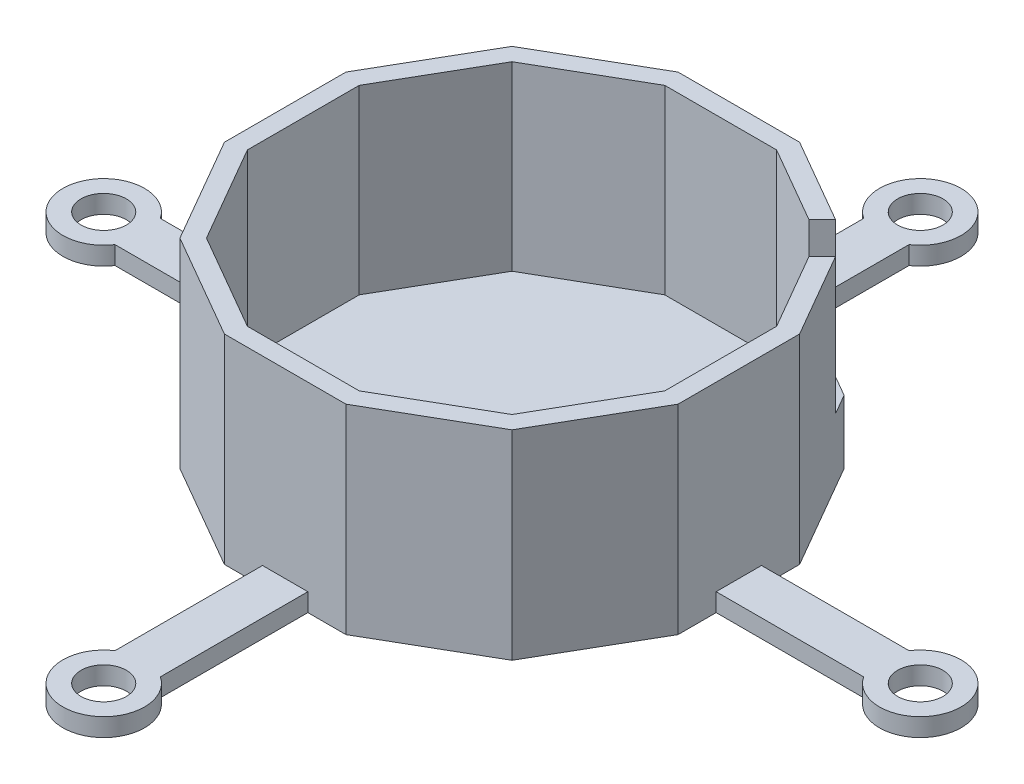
ISO-10303-21;
HEADER;
FILE_DESCRIPTION(('STEP AP214'),'2;1');
FILE_NAME('part.step','',(''),(''),'','','');
FILE_SCHEMA(('AUTOMOTIVE_DESIGN { 1 0 10303 214 1 1 1 1 }'));
ENDSEC;
DATA;
#1=APPLICATION_CONTEXT('core data for automotive mechanical design processes');
#2=APPLICATION_PROTOCOL_DEFINITION('international standard','automotive_design',2000,#1);
#3=PRODUCT_CONTEXT('',#1,'mechanical');
#4=PRODUCT('Part','Part','',(#3));
#5=PRODUCT_RELATED_PRODUCT_CATEGORY('part','',(#4));
#6=PRODUCT_DEFINITION_FORMATION('','',#4);
#7=PRODUCT_DEFINITION_CONTEXT('part definition',#1,'design');
#8=PRODUCT_DEFINITION('design','',#6,#7);
#9=PRODUCT_DEFINITION_SHAPE('','',#8);
#10=(LENGTH_UNIT() NAMED_UNIT(*) SI_UNIT(.MILLI.,.METRE.));
#11=(NAMED_UNIT(*) PLANE_ANGLE_UNIT() SI_UNIT($,.RADIAN.));
#12=(NAMED_UNIT(*) SI_UNIT($,.STERADIAN.) SOLID_ANGLE_UNIT());
#13=UNCERTAINTY_MEASURE_WITH_UNIT(LENGTH_MEASURE(1.E-05),#10,'distance_accuracy_value','');
#14=(GEOMETRIC_REPRESENTATION_CONTEXT(3) GLOBAL_UNCERTAINTY_ASSIGNED_CONTEXT((#13)) GLOBAL_UNIT_ASSIGNED_CONTEXT((#10,
#11,#12)) REPRESENTATION_CONTEXT('',''));
#15=CARTESIAN_POINT('',(0.,0.,0.));
#16=DIRECTION('',(0.,0.,1.));
#17=DIRECTION('',(1.,0.,0.));
#18=AXIS2_PLACEMENT_3D('',#15,#16,#17);
#19=CARTESIAN_POINT('',(25.,22.,2.5));
#20=DIRECTION('',(0.,0.,-1.));
#21=DIRECTION('',(-1.,0.,0.));
#22=AXIS2_PLACEMENT_3D('',#19,#20,#21);
#23=PLANE('',#22);
#24=DIRECTION('',(1.,0.,0.));
#25=VECTOR('',#24,1.);
#26=CARTESIAN_POINT('',(25.,2.,2.5));
#27=LINE('',#26,#25);
#28=CARTESIAN_POINT('',(25.,2.,2.5));
#29=VERTEX_POINT('',#28);
#30=CARTESIAN_POINT('',(41.2583426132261,2.,2.5));
#31=VERTEX_POINT('',#30);
#32=EDGE_CURVE('E476',#29,#31,#27,.T.);
#33=ORIENTED_EDGE('',*,*,#32,.F.);
#34=DIRECTION('',(0.,-1.,0.));
#35=VECTOR('',#34,1.);
#36=CARTESIAN_POINT('',(25.,22.,2.5));
#37=LINE('',#36,#35);
#38=CARTESIAN_POINT('',(25.,0.,2.5));
#39=VERTEX_POINT('',#38);
#40=EDGE_CURVE('E707',#29,#39,#37,.T.);
#41=ORIENTED_EDGE('',*,*,#40,.T.);
#42=DIRECTION('',(1.,0.,0.));
#43=VECTOR('',#42,1.);
#44=CARTESIAN_POINT('',(25.,0.,2.5));
#45=LINE('',#44,#43);
#46=CARTESIAN_POINT('',(41.2583426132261,0.,2.5));
#47=VERTEX_POINT('',#46);
#48=EDGE_CURVE('E520',#39,#47,#45,.T.);
#49=ORIENTED_EDGE('',*,*,#48,.T.);
#50=DIRECTION('',(0.,-1.,0.));
#51=VECTOR('',#50,1.);
#52=CARTESIAN_POINT('',(41.2583426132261,22.,2.5));
#53=LINE('',#52,#51);
#54=EDGE_CURVE('E704',#31,#47,#53,.T.);
#55=ORIENTED_EDGE('',*,*,#54,.F.);
#56=EDGE_LOOP('',(#33,#41,#49,#55));
#57=FACE_BOUND('',#56,.T.);
#58=ADVANCED_FACE('F40',(#57),#23,.F.);
#59=CARTESIAN_POINT('',(45.,22.,0.));
#60=DIRECTION('',(0.,-1.,0.));
#61=DIRECTION('',(0.,0.,-1.));
#62=AXIS2_PLACEMENT_3D('',#59,#60,#61);
#63=CYLINDRICAL_SURFACE('',#62,4.5);
#64=CARTESIAN_POINT('',(45.,2.,0.));
#65=DIRECTION('',(0.,1.,0.));
#66=DIRECTION('',(0.,0.,1.));
#67=AXIS2_PLACEMENT_3D('',#64,#65,#66);
#68=CIRCLE('',#67,4.5);
#69=CARTESIAN_POINT('',(41.2583426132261,2.,-2.5));
#70=VERTEX_POINT('',#69);
#71=EDGE_CURVE('E473',#31,#70,#68,.T.);
#72=ORIENTED_EDGE('',*,*,#71,.F.);
#73=ORIENTED_EDGE('',*,*,#54,.T.);
#74=CARTESIAN_POINT('',(45.,0.,0.));
#75=DIRECTION('',(0.,1.,0.));
#76=DIRECTION('',(0.,0.,1.));
#77=AXIS2_PLACEMENT_3D('',#74,#75,#76);
#78=CIRCLE('',#77,4.5);
#79=CARTESIAN_POINT('',(41.2583426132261,0.,-2.5));
#80=VERTEX_POINT('',#79);
#81=EDGE_CURVE('E524',#47,#80,#78,.T.);
#82=ORIENTED_EDGE('',*,*,#81,.T.);
#83=DIRECTION('',(0.,-1.,0.));
#84=VECTOR('',#83,1.);
#85=CARTESIAN_POINT('',(41.2583426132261,22.,-2.5));
#86=LINE('',#85,#84);
#87=EDGE_CURVE('E701',#70,#80,#86,.T.);
#88=ORIENTED_EDGE('',*,*,#87,.F.);
#89=EDGE_LOOP('',(#72,#73,#82,#88));
#90=FACE_BOUND('',#89,.T.);
#91=ADVANCED_FACE('F787',(#90),#63,.T.);
#92=CARTESIAN_POINT('',(25.,22.,-2.5));
#93=DIRECTION('',(0.,0.,1.));
#94=DIRECTION('',(1.,0.,0.));
#95=AXIS2_PLACEMENT_3D('',#92,#93,#94);
#96=PLANE('',#95);
#97=DIRECTION('',(-1.,0.,0.));
#98=VECTOR('',#97,1.);
#99=CARTESIAN_POINT('',(25.,2.,-2.5));
#100=LINE('',#99,#98);
#101=CARTESIAN_POINT('',(25.,2.,-2.5));
#102=VERTEX_POINT('',#101);
#103=EDGE_CURVE('E470',#70,#102,#100,.T.);
#104=ORIENTED_EDGE('',*,*,#103,.F.);
#105=ORIENTED_EDGE('',*,*,#87,.T.);
#106=DIRECTION('',(-1.,0.,0.));
#107=VECTOR('',#106,1.);
#108=CARTESIAN_POINT('',(25.,0.,-2.5));
#109=LINE('',#108,#107);
#110=CARTESIAN_POINT('',(25.,0.,-2.5));
#111=VERTEX_POINT('',#110);
#112=EDGE_CURVE('E528',#80,#111,#109,.T.);
#113=ORIENTED_EDGE('',*,*,#112,.T.);
#114=DIRECTION('',(0.,-1.,0.));
#115=VECTOR('',#114,1.);
#116=CARTESIAN_POINT('',(25.,22.,-2.5));
#117=LINE('',#116,#115);
#118=EDGE_CURVE('E698',#102,#111,#117,.T.);
#119=ORIENTED_EDGE('',*,*,#118,.F.);
#120=EDGE_LOOP('',(#104,#105,#113,#119));
#121=FACE_BOUND('',#120,.T.);
#122=ADVANCED_FACE('F792',(#121),#96,.F.);
#123=CARTESIAN_POINT('',(2.5,22.,-24.9999999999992));
#124=DIRECTION('',(-1.,0.,0.));
#125=DIRECTION('',(0.,0.,1.));
#126=AXIS2_PLACEMENT_3D('',#123,#124,#125);
#127=PLANE('',#126);
#128=DIRECTION('',(0.,0.,-1.));
#129=VECTOR('',#128,1.);
#130=CARTESIAN_POINT('',(2.5,2.,-24.9999999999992));
#131=LINE('',#130,#129);
#132=CARTESIAN_POINT('',(2.49999999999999,2.,-25.));
#133=VERTEX_POINT('',#132);
#134=CARTESIAN_POINT('',(2.5,2.,-41.2583426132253));
#135=VERTEX_POINT('',#134);
#136=EDGE_CURVE('E467',#133,#135,#131,.T.);
#137=ORIENTED_EDGE('',*,*,#136,.F.);
#138=DIRECTION('',(0.,-1.,0.));
#139=VECTOR('',#138,1.);
#140=CARTESIAN_POINT('',(2.5,22.,-24.9999999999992));
#141=LINE('',#140,#139);
#142=CARTESIAN_POINT('',(2.5,0.,-24.9999999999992));
#143=VERTEX_POINT('',#142);
#144=EDGE_CURVE('E686',#133,#143,#141,.T.);
#145=ORIENTED_EDGE('',*,*,#144,.T.);
#146=DIRECTION('',(0.,0.,-1.));
#147=VECTOR('',#146,1.);
#148=CARTESIAN_POINT('',(2.5,0.,-24.9999999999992));
#149=LINE('',#148,#147);
#150=CARTESIAN_POINT('',(2.5,0.,-41.2583426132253));
#151=VERTEX_POINT('',#150);
#152=EDGE_CURVE('E548',#143,#151,#149,.T.);
#153=ORIENTED_EDGE('',*,*,#152,.T.);
#154=DIRECTION('',(0.,-1.,0.));
#155=VECTOR('',#154,1.);
#156=CARTESIAN_POINT('',(2.5,22.,-41.2583426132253));
#157=LINE('',#156,#155);
#158=EDGE_CURVE('E683',#135,#151,#157,.T.);
#159=ORIENTED_EDGE('',*,*,#158,.F.);
#160=EDGE_LOOP('',(#137,#145,#153,#159));
#161=FACE_BOUND('',#160,.T.);
#162=ADVANCED_FACE('F911',(#161),#127,.F.);
#163=CARTESIAN_POINT('',(0.,22.,-44.9999999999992));
#164=DIRECTION('',(0.,-1.,0.));
#165=DIRECTION('',(0.,0.,-1.));
#166=AXIS2_PLACEMENT_3D('',#163,#164,#165);
#167=CYLINDRICAL_SURFACE('',#166,4.5);
#168=CARTESIAN_POINT('',(0.,2.,-44.9999999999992));
#169=DIRECTION('',(0.,1.,0.));
#170=DIRECTION('',(0.,0.,1.));
#171=AXIS2_PLACEMENT_3D('',#168,#169,#170);
#172=CIRCLE('',#171,4.5);
#173=CARTESIAN_POINT('',(-2.50000000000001,2.,-41.2583426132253));
#174=VERTEX_POINT('',#173);
#175=EDGE_CURVE('E464',#135,#174,#172,.T.);
#176=ORIENTED_EDGE('',*,*,#175,.F.);
#177=ORIENTED_EDGE('',*,*,#158,.T.);
#178=CARTESIAN_POINT('',(0.,0.,-44.9999999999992));
#179=DIRECTION('',(0.,1.,0.));
#180=DIRECTION('',(0.,0.,1.));
#181=AXIS2_PLACEMENT_3D('',#178,#179,#180);
#182=CIRCLE('',#181,4.5);
#183=CARTESIAN_POINT('',(-2.50000000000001,0.,-41.2583426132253));
#184=VERTEX_POINT('',#183);
#185=EDGE_CURVE('E552',#151,#184,#182,.T.);
#186=ORIENTED_EDGE('',*,*,#185,.T.);
#187=DIRECTION('',(0.,-1.,0.));
#188=VECTOR('',#187,1.);
#189=CARTESIAN_POINT('',(-2.50000000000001,22.,-41.2583426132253));
#190=LINE('',#189,#188);
#191=EDGE_CURVE('E680',#174,#184,#190,.T.);
#192=ORIENTED_EDGE('',*,*,#191,.F.);
#193=EDGE_LOOP('',(#176,#177,#186,#192));
#194=FACE_BOUND('',#193,.T.);
#195=ADVANCED_FACE('F907',(#194),#167,.T.);
#196=CARTESIAN_POINT('',(-2.5,22.,-24.9999999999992));
#197=DIRECTION('',(1.,0.,0.));
#198=DIRECTION('',(0.,0.,-1.));
#199=AXIS2_PLACEMENT_3D('',#196,#197,#198);
#200=PLANE('',#199);
#201=DIRECTION('',(0.,0.,1.));
#202=VECTOR('',#201,1.);
#203=CARTESIAN_POINT('',(-2.5,2.,-24.9999999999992));
#204=LINE('',#203,#202);
#205=CARTESIAN_POINT('',(-2.5,2.,-25.));
#206=VERTEX_POINT('',#205);
#207=EDGE_CURVE('E461',#174,#206,#204,.T.);
#208=ORIENTED_EDGE('',*,*,#207,.F.);
#209=ORIENTED_EDGE('',*,*,#191,.T.);
#210=DIRECTION('',(0.,0.,1.));
#211=VECTOR('',#210,1.);
#212=CARTESIAN_POINT('',(-2.5,0.,-24.9999999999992));
#213=LINE('',#212,#211);
#214=CARTESIAN_POINT('',(-2.5,0.,-24.9999999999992));
#215=VERTEX_POINT('',#214);
#216=EDGE_CURVE('E556',#184,#215,#213,.T.);
#217=ORIENTED_EDGE('',*,*,#216,.T.);
#218=DIRECTION('',(0.,-1.,0.));
#219=VECTOR('',#218,1.);
#220=CARTESIAN_POINT('',(-2.5,22.,-24.9999999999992));
#221=LINE('',#220,#219);
#222=EDGE_CURVE('E677',#206,#215,#221,.T.);
#223=ORIENTED_EDGE('',*,*,#222,.F.);
#224=EDGE_LOOP('',(#208,#209,#217,#223));
#225=FACE_BOUND('',#224,.T.);
#226=ADVANCED_FACE('F901',(#225),#200,.F.);
#227=CARTESIAN_POINT('',(25.,22.,-6.69872981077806));
#228=DIRECTION('',(-1.,0.,0.));
#229=DIRECTION('',(0.,0.,1.));
#230=AXIS2_PLACEMENT_3D('',#227,#228,#229);
#231=PLANE('',#230);
#232=DIRECTION('',(0.,-1.,0.));
#233=VECTOR('',#232,1.);
#234=CARTESIAN_POINT('',(25.,22.,-6.69872981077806));
#235=LINE('',#234,#233);
#236=CARTESIAN_POINT('',(25.,22.,-6.69872981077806));
#237=VERTEX_POINT('',#236);
#238=CARTESIAN_POINT('',(25.,0.,-6.69872981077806));
#239=VERTEX_POINT('',#238);
#240=EDGE_CURVE('E695',#237,#239,#235,.T.);
#241=ORIENTED_EDGE('',*,*,#240,.F.);
#242=DIRECTION('',(0.,0.,-1.));
#243=VECTOR('',#242,1.);
#244=CARTESIAN_POINT('',(25.,22.,2.5));
#245=LINE('',#244,#243);
#246=CARTESIAN_POINT('',(25.,22.,6.69872981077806));
#247=VERTEX_POINT('',#246);
#248=EDGE_CURVE('E480',#247,#237,#245,.T.);
#249=ORIENTED_EDGE('',*,*,#248,.F.);
#250=DIRECTION('',(0.,-1.,0.));
#251=VECTOR('',#250,1.);
#252=CARTESIAN_POINT('',(25.,22.,6.69872981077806));
#253=LINE('',#252,#251);
#254=CARTESIAN_POINT('',(25.,0.,6.69872981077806));
#255=VERTEX_POINT('',#254);
#256=EDGE_CURVE('E516',#247,#255,#253,.T.);
#257=ORIENTED_EDGE('',*,*,#256,.T.);
#258=DIRECTION('',(0.,0.,-1.));
#259=VECTOR('',#258,1.);
#260=CARTESIAN_POINT('',(25.,0.,2.5));
#261=LINE('',#260,#259);
#262=EDGE_CURVE('E479',#255,#39,#261,.T.);
#263=ORIENTED_EDGE('',*,*,#262,.T.);
#264=ORIENTED_EDGE('',*,*,#40,.F.);
#265=DIRECTION('',(0.,0.,1.));
#266=VECTOR('',#265,1.);
#267=CARTESIAN_POINT('',(25.,2.,-6.69872981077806));
#268=LINE('',#267,#266);
#269=EDGE_CURVE('E398',#102,#29,#268,.T.);
#270=ORIENTED_EDGE('',*,*,#269,.F.);
#271=ORIENTED_EDGE('',*,*,#118,.T.);
#272=DIRECTION('',(0.,0.,-1.));
#273=VECTOR('',#272,1.);
#274=CARTESIAN_POINT('',(25.,0.,-6.69872981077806));
#275=LINE('',#274,#273);
#276=EDGE_CURVE('E532',#111,#239,#275,.T.);
#277=ORIENTED_EDGE('',*,*,#276,.T.);
#278=EDGE_LOOP('',(#241,#249,#257,#263,#264,#270,#271,#277));
#279=FACE_BOUND('',#278,.T.);
#280=ADVANCED_FACE('F803',(#279),#231,.F.);
#281=CARTESIAN_POINT('',(25.,22.,-6.69872981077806));
#282=DIRECTION('',(-0.866025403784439,0.,0.5));
#283=DIRECTION('',(0.5,0.,0.866025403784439));
#284=AXIS2_PLACEMENT_3D('',#281,#282,#283);
#285=PLANE('',#284);
#286=DIRECTION('',(0.5,0.,0.866025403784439));
#287=VECTOR('',#286,1.);
#288=CARTESIAN_POINT('',(25.,7.,-6.69872981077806));
#289=LINE('',#288,#287);
#290=CARTESIAN_POINT('',(18.3012701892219,7.,-18.3012701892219));
#291=VERTEX_POINT('',#290);
#292=CARTESIAN_POINT('',(19.5953654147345,7.,-16.0598315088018));
#293=VERTEX_POINT('',#292);
#294=EDGE_CURVE('E826',#291,#293,#289,.T.);
#295=ORIENTED_EDGE('',*,*,#294,.T.);
#296=DIRECTION('',(0.,1.,0.));
#297=VECTOR('',#296,1.);
#298=CARTESIAN_POINT('',(19.5953654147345,22.,-16.0598315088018));
#299=LINE('',#298,#297);
#300=CARTESIAN_POINT('',(19.5953654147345,22.,-16.0598315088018));
#301=VERTEX_POINT('',#300);
#302=EDGE_CURVE('E825',#293,#301,#299,.T.);
#303=ORIENTED_EDGE('',*,*,#302,.T.);
#304=DIRECTION('',(-0.5,0.,-0.866025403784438));
#305=VECTOR('',#304,1.);
#306=CARTESIAN_POINT('',(25.,22.,-6.69872981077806));
#307=LINE('',#306,#305);
#308=EDGE_CURVE('E339',#237,#301,#307,.T.);
#309=ORIENTED_EDGE('',*,*,#308,.F.);
#310=ORIENTED_EDGE('',*,*,#240,.T.);
#311=DIRECTION('',(-0.5,0.,-0.866025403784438));
#312=VECTOR('',#311,1.);
#313=CARTESIAN_POINT('',(25.,0.,-6.69872981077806));
#314=LINE('',#313,#312);
#315=CARTESIAN_POINT('',(18.3012701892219,0.,-18.3012701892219));
#316=VERTEX_POINT('',#315);
#317=EDGE_CURVE('E536',#239,#316,#314,.T.);
#318=ORIENTED_EDGE('',*,*,#317,.T.);
#319=DIRECTION('',(0.,-1.,0.));
#320=VECTOR('',#319,1.);
#321=CARTESIAN_POINT('',(18.3012701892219,22.,-18.3012701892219));
#322=LINE('',#321,#320);
#323=EDGE_CURVE('E692',#291,#316,#322,.T.);
#324=ORIENTED_EDGE('',*,*,#323,.F.);
#325=EDGE_LOOP('',(#295,#303,#309,#310,#318,#324));
#326=FACE_BOUND('',#325,.T.);
#327=ADVANCED_FACE('F824',(#326),#285,.F.);
#328=CARTESIAN_POINT('',(18.3012701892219,22.,-18.3012701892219));
#329=DIRECTION('',(-0.5,0.,0.866025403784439));
#330=DIRECTION('',(0.866025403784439,0.,0.5));
#331=AXIS2_PLACEMENT_3D('',#328,#329,#330);
#332=PLANE('',#331);
#333=DIRECTION('',(-0.866025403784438,0.,-0.5));
#334=VECTOR('',#333,1.);
#335=CARTESIAN_POINT('',(18.3012701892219,22.,-18.3012701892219));
#336=LINE('',#335,#334);
#337=CARTESIAN_POINT('',(16.0598315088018,22.,-19.5953654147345));
#338=VERTEX_POINT('',#337);
#339=CARTESIAN_POINT('',(6.69872981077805,22.,-25.));
#340=VERTEX_POINT('',#339);
#341=EDGE_CURVE('E486',#338,#340,#336,.T.);
#342=ORIENTED_EDGE('',*,*,#341,.F.);
#343=DIRECTION('',(0.,-1.,0.));
#344=VECTOR('',#343,1.);
#345=CARTESIAN_POINT('',(16.0598315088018,22.,-19.5953654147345));
#346=LINE('',#345,#344);
#347=CARTESIAN_POINT('',(16.0598315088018,7.,-19.5953654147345));
#348=VERTEX_POINT('',#347);
#349=EDGE_CURVE('E828',#338,#348,#346,.T.);
#350=ORIENTED_EDGE('',*,*,#349,.T.);
#351=DIRECTION('',(0.866025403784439,0.,0.5));
#352=VECTOR('',#351,1.);
#353=CARTESIAN_POINT('',(18.3012701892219,7.,-18.3012701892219));
#354=LINE('',#353,#352);
#355=EDGE_CURVE('E836',#348,#291,#354,.T.);
#356=ORIENTED_EDGE('',*,*,#355,.T.);
#357=ORIENTED_EDGE('',*,*,#323,.T.);
#358=DIRECTION('',(-0.866025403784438,0.,-0.5));
#359=VECTOR('',#358,1.);
#360=CARTESIAN_POINT('',(18.3012701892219,0.,-18.3012701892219));
#361=LINE('',#360,#359);
#362=CARTESIAN_POINT('',(6.69872981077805,0.,-25.));
#363=VERTEX_POINT('',#362);
#364=EDGE_CURVE('E540',#316,#363,#361,.T.);
#365=ORIENTED_EDGE('',*,*,#364,.T.);
#366=DIRECTION('',(0.,-1.,0.));
#367=VECTOR('',#366,1.);
#368=CARTESIAN_POINT('',(6.69872981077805,22.,-25.));
#369=LINE('',#368,#367);
#370=EDGE_CURVE('E689',#340,#363,#369,.T.);
#371=ORIENTED_EDGE('',*,*,#370,.F.);
#372=EDGE_LOOP('',(#342,#350,#356,#357,#365,#371));
#373=FACE_BOUND('',#372,.T.);
#374=ADVANCED_FACE('F915',(#373),#332,.F.);
#375=CARTESIAN_POINT('',(-6.69872981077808,22.,-25.));
#376=DIRECTION('',(-1.84266839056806E-13,0.,1.));
#377=DIRECTION('',(1.,0.,1.84266839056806E-13));
#378=AXIS2_PLACEMENT_3D('',#375,#376,#377);
#379=PLANE('',#378);
#380=DIRECTION('',(0.,-1.,0.));
#381=VECTOR('',#380,1.);
#382=CARTESIAN_POINT('',(-6.69872981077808,22.,-25.));
#383=LINE('',#382,#381);
#384=CARTESIAN_POINT('',(-6.69872981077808,22.,-25.));
#385=VERTEX_POINT('',#384);
#386=CARTESIAN_POINT('',(-6.69872981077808,0.,-25.));
#387=VERTEX_POINT('',#386);
#388=EDGE_CURVE('E674',#385,#387,#383,.T.);
#389=ORIENTED_EDGE('',*,*,#388,.F.);
#390=DIRECTION('',(-1.,0.,1.85919456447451E-13));
#391=VECTOR('',#390,1.);
#392=CARTESIAN_POINT('',(2.5,22.,-24.9999999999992));
#393=LINE('',#392,#391);
#394=EDGE_CURVE('E489',#340,#385,#393,.T.);
#395=ORIENTED_EDGE('',*,*,#394,.F.);
#396=ORIENTED_EDGE('',*,*,#370,.T.);
#397=DIRECTION('',(-1.,0.,1.85919456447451E-13));
#398=VECTOR('',#397,1.);
#399=CARTESIAN_POINT('',(2.5,0.,-24.9999999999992));
#400=LINE('',#399,#398);
#401=EDGE_CURVE('E544',#363,#143,#400,.T.);
#402=ORIENTED_EDGE('',*,*,#401,.T.);
#403=ORIENTED_EDGE('',*,*,#144,.F.);
#404=DIRECTION('',(1.,0.,0.));
#405=VECTOR('',#404,1.);
#406=CARTESIAN_POINT('',(-6.69872981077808,2.,-25.));
#407=LINE('',#406,#405);
#408=EDGE_CURVE('E355',#206,#133,#407,.T.);
#409=ORIENTED_EDGE('',*,*,#408,.F.);
#410=ORIENTED_EDGE('',*,*,#222,.T.);
#411=DIRECTION('',(-1.,0.,-1.84266839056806E-13));
#412=VECTOR('',#411,1.);
#413=CARTESIAN_POINT('',(-6.69872981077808,0.,-25.));
#414=LINE('',#413,#412);
#415=EDGE_CURVE('E560',#215,#387,#414,.T.);
#416=ORIENTED_EDGE('',*,*,#415,.T.);
#417=EDGE_LOOP('',(#389,#395,#396,#402,#403,#409,#410,#416));
#418=FACE_BOUND('',#417,.T.);
#419=ADVANCED_FACE('F895',(#418),#379,.F.);
#420=CARTESIAN_POINT('',(-6.69872981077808,22.,-25.));
#421=DIRECTION('',(0.5,0.,0.866025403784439));
#422=DIRECTION('',(0.866025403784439,0.,-0.5));
#423=AXIS2_PLACEMENT_3D('',#420,#421,#422);
#424=PLANE('',#423);
#425=DIRECTION('',(-0.866025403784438,0.,0.5));
#426=VECTOR('',#425,1.);
#427=CARTESIAN_POINT('',(-6.69872981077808,0.,-25.));
#428=LINE('',#427,#426);
#429=CARTESIAN_POINT('',(-18.3012701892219,0.,-18.3012701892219));
#430=VERTEX_POINT('',#429);
#431=EDGE_CURVE('E564',#387,#430,#428,.T.);
#432=ORIENTED_EDGE('',*,*,#431,.T.);
#433=DIRECTION('',(0.,-1.,0.));
#434=VECTOR('',#433,1.);
#435=CARTESIAN_POINT('',(-18.3012701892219,22.,-18.3012701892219));
#436=LINE('',#435,#434);
#437=CARTESIAN_POINT('',(-18.3012701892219,22.,-18.3012701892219));
#438=VERTEX_POINT('',#437);
#439=EDGE_CURVE('E670',#438,#430,#436,.T.);
#440=ORIENTED_EDGE('',*,*,#439,.F.);
#441=DIRECTION('',(-0.866025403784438,0.,0.5));
#442=VECTOR('',#441,1.);
#443=CARTESIAN_POINT('',(-6.69872981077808,22.,-25.));
#444=LINE('',#443,#442);
#445=EDGE_CURVE('E492',#385,#438,#444,.T.);
#446=ORIENTED_EDGE('',*,*,#445,.F.);
#447=ORIENTED_EDGE('',*,*,#388,.T.);
#448=EDGE_LOOP('',(#432,#440,#446,#447));
#449=FACE_BOUND('',#448,.T.);
#450=ADVANCED_FACE('F891',(#449),#424,.F.);
#451=CARTESIAN_POINT('',(-18.3012701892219,22.,-18.3012701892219));
#452=DIRECTION('',(0.866025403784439,0.,0.5));
#453=DIRECTION('',(0.5,0.,-0.866025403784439));
#454=AXIS2_PLACEMENT_3D('',#451,#452,#453);
#455=PLANE('',#454);
#456=DIRECTION('',(-0.5,0.,0.866025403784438));
#457=VECTOR('',#456,1.);
#458=CARTESIAN_POINT('',(-18.3012701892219,0.,-18.3012701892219));
#459=LINE('',#458,#457);
#460=CARTESIAN_POINT('',(-25.,0.,-6.69872981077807));
#461=VERTEX_POINT('',#460);
#462=EDGE_CURVE('E567',#430,#461,#459,.T.);
#463=ORIENTED_EDGE('',*,*,#462,.T.);
#464=DIRECTION('',(0.,-1.,0.));
#465=VECTOR('',#464,1.);
#466=CARTESIAN_POINT('',(-25.,22.,-6.69872981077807));
#467=LINE('',#466,#465);
#468=CARTESIAN_POINT('',(-25.,22.,-6.69872981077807));
#469=VERTEX_POINT('',#468);
#470=EDGE_CURVE('E667',#469,#461,#467,.T.);
#471=ORIENTED_EDGE('',*,*,#470,.F.);
#472=DIRECTION('',(-0.5,0.,0.866025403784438));
#473=VECTOR('',#472,1.);
#474=CARTESIAN_POINT('',(-18.3012701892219,22.,-18.3012701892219));
#475=LINE('',#474,#473);
#476=EDGE_CURVE('E495',#438,#469,#475,.T.);
#477=ORIENTED_EDGE('',*,*,#476,.F.);
#478=ORIENTED_EDGE('',*,*,#439,.T.);
#479=EDGE_LOOP('',(#463,#471,#477,#478));
#480=FACE_BOUND('',#479,.T.);
#481=ADVANCED_FACE('F886',(#480),#455,.F.);
#482=CARTESIAN_POINT('',(-24.9999999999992,22.,-2.49999999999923));
#483=DIRECTION('',(0.,0.,1.));
#484=DIRECTION('',(1.,0.,0.));
#485=AXIS2_PLACEMENT_3D('',#482,#483,#484);
#486=PLANE('',#485);
#487=DIRECTION('',(0.,-1.,0.));
#488=VECTOR('',#487,1.);
#489=CARTESIAN_POINT('',(-41.2583426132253,22.,-2.49999999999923));
#490=LINE('',#489,#488);
#491=CARTESIAN_POINT('',(-41.2583426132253,2.,-2.49999999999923));
#492=VERTEX_POINT('',#491);
#493=CARTESIAN_POINT('',(-41.2583426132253,0.,-2.49999999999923));
#494=VERTEX_POINT('',#493);
#495=EDGE_CURVE('E661',#492,#494,#490,.T.);
#496=ORIENTED_EDGE('',*,*,#495,.F.);
#497=DIRECTION('',(1.,0.,0.));
#498=VECTOR('',#497,1.);
#499=CARTESIAN_POINT('',(-24.9999999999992,2.,-2.49999999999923));
#500=LINE('',#499,#498);
#501=CARTESIAN_POINT('',(-25.,2.,-2.49999999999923));
#502=VERTEX_POINT('',#501);
#503=EDGE_CURVE('E457',#492,#502,#500,.T.);
#504=ORIENTED_EDGE('',*,*,#503,.T.);
#505=DIRECTION('',(0.,-1.,0.));
#506=VECTOR('',#505,1.);
#507=CARTESIAN_POINT('',(-24.9999999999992,22.,-2.49999999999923));
#508=LINE('',#507,#506);
#509=CARTESIAN_POINT('',(-24.9999999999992,0.,-2.49999999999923));
#510=VERTEX_POINT('',#509);
#511=EDGE_CURVE('E664',#502,#510,#508,.T.);
#512=ORIENTED_EDGE('',*,*,#511,.T.);
#513=DIRECTION('',(-1.,0.,0.));
#514=VECTOR('',#513,1.);
#515=CARTESIAN_POINT('',(-24.9999999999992,0.,-2.49999999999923));
#516=LINE('',#515,#514);
#517=EDGE_CURVE('E575',#510,#494,#516,.T.);
#518=ORIENTED_EDGE('',*,*,#517,.T.);
#519=EDGE_LOOP('',(#496,#504,#512,#518));
#520=FACE_BOUND('',#519,.T.);
#521=ADVANCED_FACE('F853',(#520),#486,.F.);
#522=CARTESIAN_POINT('',(-44.9999999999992,22.,7.74588882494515E-13));
#523=DIRECTION('',(0.,-1.,0.));
#524=DIRECTION('',(0.,0.,-1.));
#525=AXIS2_PLACEMENT_3D('',#522,#523,#524);
#526=CYLINDRICAL_SURFACE('',#525,4.5);
#527=DIRECTION('',(0.,-1.,0.));
#528=VECTOR('',#527,1.);
#529=CARTESIAN_POINT('',(-41.2583426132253,22.,2.50000000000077));
#530=LINE('',#529,#528);
#531=CARTESIAN_POINT('',(-41.2583426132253,2.,2.50000000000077));
#532=VERTEX_POINT('',#531);
#533=CARTESIAN_POINT('',(-41.2583426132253,0.,2.50000000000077));
#534=VERTEX_POINT('',#533);
#535=EDGE_CURVE('E658',#532,#534,#530,.T.);
#536=ORIENTED_EDGE('',*,*,#535,.F.);
#537=CARTESIAN_POINT('',(-44.9999999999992,2.,7.74588882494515E-13));
#538=DIRECTION('',(0.,-1.,0.));
#539=DIRECTION('',(0.,0.,-1.));
#540=AXIS2_PLACEMENT_3D('',#537,#538,#539);
#541=CIRCLE('',#540,4.5);
#542=EDGE_CURVE('E453',#532,#492,#541,.T.);
#543=ORIENTED_EDGE('',*,*,#542,.T.);
#544=ORIENTED_EDGE('',*,*,#495,.T.);
#545=CARTESIAN_POINT('',(-44.9999999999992,0.,7.74588882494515E-13));
#546=DIRECTION('',(0.,1.,0.));
#547=DIRECTION('',(0.,0.,1.));
#548=AXIS2_PLACEMENT_3D('',#545,#546,#547);
#549=CIRCLE('',#548,4.5);
#550=EDGE_CURVE('E579',#494,#534,#549,.T.);
#551=ORIENTED_EDGE('',*,*,#550,.T.);
#552=EDGE_LOOP('',(#536,#543,#544,#551));
#553=FACE_BOUND('',#552,.T.);
#554=ADVANCED_FACE('F865',(#553),#526,.T.);
#555=CARTESIAN_POINT('',(-24.9999999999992,22.,2.50000000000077));
#556=DIRECTION('',(0.,0.,-1.));
#557=DIRECTION('',(-1.,0.,0.));
#558=AXIS2_PLACEMENT_3D('',#555,#556,#557);
#559=PLANE('',#558);
#560=DIRECTION('',(0.,-1.,0.));
#561=VECTOR('',#560,1.);
#562=CARTESIAN_POINT('',(-24.9999999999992,22.,2.50000000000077));
#563=LINE('',#562,#561);
#564=CARTESIAN_POINT('',(-25.,2.,2.50000000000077));
#565=VERTEX_POINT('',#564);
#566=CARTESIAN_POINT('',(-24.9999999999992,0.,2.50000000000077));
#567=VERTEX_POINT('',#566);
#568=EDGE_CURVE('E655',#565,#567,#563,.T.);
#569=ORIENTED_EDGE('',*,*,#568,.F.);
#570=DIRECTION('',(-1.,0.,0.));
#571=VECTOR('',#570,1.);
#572=CARTESIAN_POINT('',(-24.9999999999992,2.,2.50000000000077));
#573=LINE('',#572,#571);
#574=EDGE_CURVE('E449',#565,#532,#573,.T.);
#575=ORIENTED_EDGE('',*,*,#574,.T.);
#576=ORIENTED_EDGE('',*,*,#535,.T.);
#577=DIRECTION('',(1.,0.,0.));
#578=VECTOR('',#577,1.);
#579=CARTESIAN_POINT('',(-24.9999999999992,0.,2.50000000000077));
#580=LINE('',#579,#578);
#581=EDGE_CURVE('E583',#534,#567,#580,.T.);
#582=ORIENTED_EDGE('',*,*,#581,.T.);
#583=EDGE_LOOP('',(#569,#575,#576,#582));
#584=FACE_BOUND('',#583,.T.);
#585=ADVANCED_FACE('F867',(#584),#559,.F.);
#586=CARTESIAN_POINT('',(-24.9999999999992,22.,2.50000000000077));
#587=DIRECTION('',(1.,0.,1.83440530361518E-13));
#588=DIRECTION('',(1.83440530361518E-13,0.,-1.));
#589=AXIS2_PLACEMENT_3D('',#586,#587,#588);
#590=PLANE('',#589);
#591=DIRECTION('',(-1.83440530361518E-13,0.,1.));
#592=VECTOR('',#591,1.);
#593=CARTESIAN_POINT('',(-24.9999999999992,0.,2.50000000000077));
#594=LINE('',#593,#592);
#595=CARTESIAN_POINT('',(-25.,0.,6.69872981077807));
#596=VERTEX_POINT('',#595);
#597=EDGE_CURVE('E587',#567,#596,#594,.T.);
#598=ORIENTED_EDGE('',*,*,#597,.T.);
#599=DIRECTION('',(0.,-1.,0.));
#600=VECTOR('',#599,1.);
#601=CARTESIAN_POINT('',(-25.,22.,6.69872981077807));
#602=LINE('',#601,#600);
#603=CARTESIAN_POINT('',(-25.,22.,6.69872981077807));
#604=VERTEX_POINT('',#603);
#605=EDGE_CURVE('E652',#604,#596,#602,.T.);
#606=ORIENTED_EDGE('',*,*,#605,.F.);
#607=DIRECTION('',(1.8344053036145E-13,0.,1.));
#608=VECTOR('',#607,1.);
#609=CARTESIAN_POINT('',(-24.9999999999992,22.,-2.49999999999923));
#610=LINE('',#609,#608);
#611=EDGE_CURVE('E498',#469,#604,#610,.T.);
#612=ORIENTED_EDGE('',*,*,#611,.F.);
#613=ORIENTED_EDGE('',*,*,#470,.T.);
#614=DIRECTION('',(1.8344053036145E-13,0.,1.));
#615=VECTOR('',#614,1.);
#616=CARTESIAN_POINT('',(-24.9999999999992,0.,-2.49999999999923));
#617=LINE('',#616,#615);
#618=EDGE_CURVE('E571',#461,#510,#617,.T.);
#619=ORIENTED_EDGE('',*,*,#618,.T.);
#620=ORIENTED_EDGE('',*,*,#511,.F.);
#621=DIRECTION('',(0.,0.,-1.));
#622=VECTOR('',#621,1.);
#623=CARTESIAN_POINT('',(-25.,2.,-6.69872981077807));
#624=LINE('',#623,#622);
#625=EDGE_CURVE('E834',#565,#502,#624,.T.);
#626=ORIENTED_EDGE('',*,*,#625,.F.);
#627=ORIENTED_EDGE('',*,*,#568,.T.);
#628=EDGE_LOOP('',(#598,#606,#612,#613,#619,#620,#626,#627));
#629=FACE_BOUND('',#628,.T.);
#630=ADVANCED_FACE('F854',(#629),#590,.F.);
#631=CARTESIAN_POINT('',(-25.,22.,6.69872981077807));
#632=DIRECTION('',(0.866025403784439,0.,-0.5));
#633=DIRECTION('',(-0.5,0.,-0.866025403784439));
#634=AXIS2_PLACEMENT_3D('',#631,#632,#633);
#635=PLANE('',#634);
#636=DIRECTION('',(0.5,0.,0.866025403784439));
#637=VECTOR('',#636,1.);
#638=CARTESIAN_POINT('',(-25.,0.,6.69872981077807));
#639=LINE('',#638,#637);
#640=CARTESIAN_POINT('',(-18.3012701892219,0.,18.3012701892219));
#641=VERTEX_POINT('',#640);
#642=EDGE_CURVE('E591',#596,#641,#639,.T.);
#643=ORIENTED_EDGE('',*,*,#642,.T.);
#644=DIRECTION('',(0.,-1.,0.));
#645=VECTOR('',#644,1.);
#646=CARTESIAN_POINT('',(-18.3012701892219,22.,18.3012701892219));
#647=LINE('',#646,#645);
#648=CARTESIAN_POINT('',(-18.3012701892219,22.,18.3012701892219));
#649=VERTEX_POINT('',#648);
#650=EDGE_CURVE('E648',#649,#641,#647,.T.);
#651=ORIENTED_EDGE('',*,*,#650,.F.);
#652=DIRECTION('',(0.5,0.,0.866025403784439));
#653=VECTOR('',#652,1.);
#654=CARTESIAN_POINT('',(-25.,22.,6.69872981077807));
#655=LINE('',#654,#653);
#656=EDGE_CURVE('E501',#604,#649,#655,.T.);
#657=ORIENTED_EDGE('',*,*,#656,.F.);
#658=ORIENTED_EDGE('',*,*,#605,.T.);
#659=EDGE_LOOP('',(#643,#651,#657,#658));
#660=FACE_BOUND('',#659,.T.);
#661=ADVANCED_FACE('F875',(#660),#635,.F.);
#662=CARTESIAN_POINT('',(-18.3012701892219,22.,18.3012701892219));
#663=DIRECTION('',(0.5,0.,-0.866025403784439));
#664=DIRECTION('',(-0.866025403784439,0.,-0.5));
#665=AXIS2_PLACEMENT_3D('',#662,#663,#664);
#666=PLANE('',#665);
#667=DIRECTION('',(0.866025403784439,0.,0.5));
#668=VECTOR('',#667,1.);
#669=CARTESIAN_POINT('',(-18.3012701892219,0.,18.3012701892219));
#670=LINE('',#669,#668);
#671=CARTESIAN_POINT('',(-6.69872981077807,0.,25.));
#672=VERTEX_POINT('',#671);
#673=EDGE_CURVE('E594',#641,#672,#670,.T.);
#674=ORIENTED_EDGE('',*,*,#673,.T.);
#675=DIRECTION('',(0.,-1.,0.));
#676=VECTOR('',#675,1.);
#677=CARTESIAN_POINT('',(-6.69872981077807,22.,25.));
#678=LINE('',#677,#676);
#679=CARTESIAN_POINT('',(-6.69872981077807,22.,25.));
#680=VERTEX_POINT('',#679);
#681=EDGE_CURVE('E645',#680,#672,#678,.T.);
#682=ORIENTED_EDGE('',*,*,#681,.F.);
#683=DIRECTION('',(0.866025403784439,0.,0.5));
#684=VECTOR('',#683,1.);
#685=CARTESIAN_POINT('',(-18.3012701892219,22.,18.3012701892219));
#686=LINE('',#685,#684);
#687=EDGE_CURVE('E504',#649,#680,#686,.T.);
#688=ORIENTED_EDGE('',*,*,#687,.F.);
#689=ORIENTED_EDGE('',*,*,#650,.T.);
#690=EDGE_LOOP('',(#674,#682,#688,#689));
#691=FACE_BOUND('',#690,.T.);
#692=ADVANCED_FACE('F878',(#691),#666,.F.);
#693=CARTESIAN_POINT('',(-2.49999999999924,22.,25.));
#694=DIRECTION('',(1.,0.,0.));
#695=DIRECTION('',(0.,0.,-1.));
#696=AXIS2_PLACEMENT_3D('',#693,#694,#695);
#697=PLANE('',#696);
#698=DIRECTION('',(0.,-1.,0.));
#699=VECTOR('',#698,1.);
#700=CARTESIAN_POINT('',(-2.49999999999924,22.,41.258342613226));
#701=LINE('',#700,#699);
#702=CARTESIAN_POINT('',(-2.49999999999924,2.,41.258342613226));
#703=VERTEX_POINT('',#702);
#704=CARTESIAN_POINT('',(-2.49999999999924,0.,41.258342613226));
#705=VERTEX_POINT('',#704);
#706=EDGE_CURVE('E639',#703,#705,#701,.T.);
#707=ORIENTED_EDGE('',*,*,#706,.F.);
#708=DIRECTION('',(0.,0.,-1.));
#709=VECTOR('',#708,1.);
#710=CARTESIAN_POINT('',(-2.49999999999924,2.,25.));
#711=LINE('',#710,#709);
#712=CARTESIAN_POINT('',(-2.49999999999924,2.,25.));
#713=VERTEX_POINT('',#712);
#714=EDGE_CURVE('E445',#703,#713,#711,.T.);
#715=ORIENTED_EDGE('',*,*,#714,.T.);
#716=DIRECTION('',(0.,-1.,0.));
#717=VECTOR('',#716,1.);
#718=CARTESIAN_POINT('',(-2.49999999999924,22.,25.));
#719=LINE('',#718,#717);
#720=CARTESIAN_POINT('',(-2.49999999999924,0.,25.));
#721=VERTEX_POINT('',#720);
#722=EDGE_CURVE('E642',#713,#721,#719,.T.);
#723=ORIENTED_EDGE('',*,*,#722,.T.);
#724=DIRECTION('',(0.,0.,1.));
#725=VECTOR('',#724,1.);
#726=CARTESIAN_POINT('',(-2.49999999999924,0.,25.));
#727=LINE('',#726,#725);
#728=EDGE_CURVE('E602',#721,#705,#727,.T.);
#729=ORIENTED_EDGE('',*,*,#728,.T.);
#730=EDGE_LOOP('',(#707,#715,#723,#729));
#731=FACE_BOUND('',#730,.T.);
#732=ADVANCED_FACE('F1377',(#731),#697,.F.);
#733=CARTESIAN_POINT('',(7.51258283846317E-13,22.,45.));
#734=DIRECTION('',(0.,-1.,0.));
#735=DIRECTION('',(0.,0.,-1.));
#736=AXIS2_PLACEMENT_3D('',#733,#734,#735);
#737=CYLINDRICAL_SURFACE('',#736,4.5);
#738=DIRECTION('',(0.,-1.,0.));
#739=VECTOR('',#738,1.);
#740=CARTESIAN_POINT('',(2.50000000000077,22.,41.2583426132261));
#741=LINE('',#740,#739);
#742=CARTESIAN_POINT('',(2.50000000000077,2.,41.2583426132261));
#743=VERTEX_POINT('',#742);
#744=CARTESIAN_POINT('',(2.50000000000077,0.,41.2583426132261));
#745=VERTEX_POINT('',#744);
#746=EDGE_CURVE('E636',#743,#745,#741,.T.);
#747=ORIENTED_EDGE('',*,*,#746,.F.);
#748=CARTESIAN_POINT('',(7.51258283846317E-13,2.,45.));
#749=DIRECTION('',(0.,-1.,0.));
#750=DIRECTION('',(0.,0.,-1.));
#751=AXIS2_PLACEMENT_3D('',#748,#749,#750);
#752=CIRCLE('',#751,4.5);
#753=EDGE_CURVE('E441',#743,#703,#752,.T.);
#754=ORIENTED_EDGE('',*,*,#753,.T.);
#755=ORIENTED_EDGE('',*,*,#706,.T.);
#756=CARTESIAN_POINT('',(7.51258283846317E-13,0.,45.));
#757=DIRECTION('',(0.,1.,0.));
#758=DIRECTION('',(0.,0.,1.));
#759=AXIS2_PLACEMENT_3D('',#756,#757,#758);
#760=CIRCLE('',#759,4.5);
#761=EDGE_CURVE('E606',#705,#745,#760,.T.);
#762=ORIENTED_EDGE('',*,*,#761,.T.);
#763=EDGE_LOOP('',(#747,#754,#755,#762));
#764=FACE_BOUND('',#763,.T.);
#765=ADVANCED_FACE('F1384',(#764),#737,.T.);
#766=CARTESIAN_POINT('',(2.50000000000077,22.,25.));
#767=DIRECTION('',(-1.,0.,0.));
#768=DIRECTION('',(0.,0.,1.));
#769=AXIS2_PLACEMENT_3D('',#766,#767,#768);
#770=PLANE('',#769);
#771=DIRECTION('',(0.,-1.,0.));
#772=VECTOR('',#771,1.);
#773=CARTESIAN_POINT('',(2.50000000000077,22.,25.));
#774=LINE('',#773,#772);
#775=CARTESIAN_POINT('',(2.50000000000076,2.,25.));
#776=VERTEX_POINT('',#775);
#777=CARTESIAN_POINT('',(2.50000000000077,0.,25.));
#778=VERTEX_POINT('',#777);
#779=EDGE_CURVE('E633',#776,#778,#774,.T.);
#780=ORIENTED_EDGE('',*,*,#779,.F.);
#781=DIRECTION('',(0.,0.,1.));
#782=VECTOR('',#781,1.);
#783=CARTESIAN_POINT('',(2.50000000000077,2.,25.));
#784=LINE('',#783,#782);
#785=EDGE_CURVE('E437',#776,#743,#784,.T.);
#786=ORIENTED_EDGE('',*,*,#785,.T.);
#787=ORIENTED_EDGE('',*,*,#746,.T.);
#788=DIRECTION('',(0.,0.,-1.));
#789=VECTOR('',#788,1.);
#790=CARTESIAN_POINT('',(2.50000000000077,0.,25.));
#791=LINE('',#790,#789);
#792=EDGE_CURVE('E610',#745,#778,#791,.T.);
#793=ORIENTED_EDGE('',*,*,#792,.T.);
#794=EDGE_LOOP('',(#780,#786,#787,#793));
#795=FACE_BOUND('',#794,.T.);
#796=ADVANCED_FACE('F1220',(#795),#770,.F.);
#797=CARTESIAN_POINT('',(2.50000000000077,22.,25.));
#798=DIRECTION('',(0.,0.,-1.));
#799=DIRECTION('',(-1.,0.,0.));
#800=AXIS2_PLACEMENT_3D('',#797,#798,#799);
#801=PLANE('',#800);
#802=DIRECTION('',(1.,0.,0.));
#803=VECTOR('',#802,1.);
#804=CARTESIAN_POINT('',(2.50000000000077,0.,25.));
#805=LINE('',#804,#803);
#806=CARTESIAN_POINT('',(6.69872981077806,0.,25.));
#807=VERTEX_POINT('',#806);
#808=EDGE_CURVE('E614',#778,#807,#805,.T.);
#809=ORIENTED_EDGE('',*,*,#808,.T.);
#810=DIRECTION('',(0.,-1.,0.));
#811=VECTOR('',#810,1.);
#812=CARTESIAN_POINT('',(6.69872981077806,22.,25.));
#813=LINE('',#812,#811);
#814=CARTESIAN_POINT('',(6.69872981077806,22.,25.));
#815=VERTEX_POINT('',#814);
#816=EDGE_CURVE('E630',#815,#807,#813,.T.);
#817=ORIENTED_EDGE('',*,*,#816,.F.);
#818=DIRECTION('',(1.,0.,0.));
#819=VECTOR('',#818,1.);
#820=CARTESIAN_POINT('',(-6.69872981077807,22.,25.));
#821=LINE('',#820,#819);
#822=EDGE_CURVE('E507',#680,#815,#821,.T.);
#823=ORIENTED_EDGE('',*,*,#822,.F.);
#824=ORIENTED_EDGE('',*,*,#681,.T.);
#825=DIRECTION('',(1.,0.,0.));
#826=VECTOR('',#825,1.);
#827=CARTESIAN_POINT('',(-6.69872981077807,0.,25.));
#828=LINE('',#827,#826);
#829=EDGE_CURVE('E598',#672,#721,#828,.T.);
#830=ORIENTED_EDGE('',*,*,#829,.T.);
#831=ORIENTED_EDGE('',*,*,#722,.F.);
#832=DIRECTION('',(-1.,0.,0.));
#833=VECTOR('',#832,1.);
#834=CARTESIAN_POINT('',(-6.69872981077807,2.,25.));
#835=LINE('',#834,#833);
#836=EDGE_CURVE('E436',#776,#713,#835,.T.);
#837=ORIENTED_EDGE('',*,*,#836,.F.);
#838=ORIENTED_EDGE('',*,*,#779,.T.);
#839=EDGE_LOOP('',(#809,#817,#823,#824,#830,#831,#837,#838));
#840=FACE_BOUND('',#839,.T.);
#841=ADVANCED_FACE('F1212',(#840),#801,.F.);
#842=CARTESIAN_POINT('',(6.69872981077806,22.,25.));
#843=DIRECTION('',(-0.5,0.,-0.866025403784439));
#844=DIRECTION('',(-0.866025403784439,0.,0.5));
#845=AXIS2_PLACEMENT_3D('',#842,#843,#844);
#846=PLANE('',#845);
#847=DIRECTION('',(0.866025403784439,0.,-0.5));
#848=VECTOR('',#847,1.);
#849=CARTESIAN_POINT('',(6.69872981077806,0.,25.));
#850=LINE('',#849,#848);
#851=CARTESIAN_POINT('',(18.3012701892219,0.,18.3012701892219));
#852=VERTEX_POINT('',#851);
#853=EDGE_CURVE('E618',#807,#852,#850,.T.);
#854=ORIENTED_EDGE('',*,*,#853,.T.);
#855=DIRECTION('',(0.,-1.,0.));
#856=VECTOR('',#855,1.);
#857=CARTESIAN_POINT('',(18.3012701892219,22.,18.3012701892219));
#858=LINE('',#857,#856);
#859=CARTESIAN_POINT('',(18.3012701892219,22.,18.3012701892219));
#860=VERTEX_POINT('',#859);
#861=EDGE_CURVE('E626',#860,#852,#858,.T.);
#862=ORIENTED_EDGE('',*,*,#861,.F.);
#863=DIRECTION('',(0.866025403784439,0.,-0.5));
#864=VECTOR('',#863,1.);
#865=CARTESIAN_POINT('',(6.69872981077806,22.,25.));
#866=LINE('',#865,#864);
#867=EDGE_CURVE('E510',#815,#860,#866,.T.);
#868=ORIENTED_EDGE('',*,*,#867,.F.);
#869=ORIENTED_EDGE('',*,*,#816,.T.);
#870=EDGE_LOOP('',(#854,#862,#868,#869));
#871=FACE_BOUND('',#870,.T.);
#872=ADVANCED_FACE('F1219',(#871),#846,.F.);
#873=CARTESIAN_POINT('',(18.3012701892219,22.,18.3012701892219));
#874=DIRECTION('',(-0.866025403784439,0.,-0.5));
#875=DIRECTION('',(-0.5,0.,0.866025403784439));
#876=AXIS2_PLACEMENT_3D('',#873,#874,#875);
#877=PLANE('',#876);
#878=DIRECTION('',(0.5,0.,-0.866025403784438));
#879=VECTOR('',#878,1.);
#880=CARTESIAN_POINT('',(18.3012701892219,0.,18.3012701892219));
#881=LINE('',#880,#879);
#882=EDGE_CURVE('E483',#852,#255,#881,.T.);
#883=ORIENTED_EDGE('',*,*,#882,.T.);
#884=ORIENTED_EDGE('',*,*,#256,.F.);
#885=DIRECTION('',(0.5,0.,-0.866025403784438));
#886=VECTOR('',#885,1.);
#887=CARTESIAN_POINT('',(18.3012701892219,22.,18.3012701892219));
#888=LINE('',#887,#886);
#889=EDGE_CURVE('E513',#860,#247,#888,.T.);
#890=ORIENTED_EDGE('',*,*,#889,.F.);
#891=ORIENTED_EDGE('',*,*,#861,.T.);
#892=EDGE_LOOP('',(#883,#884,#890,#891));
#893=FACE_BOUND('',#892,.T.);
#894=ADVANCED_FACE('F1407',(#893),#877,.F.);
#895=CARTESIAN_POINT('',(7.51258283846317E-13,22.,45.));
#896=DIRECTION('',(0.,1.,0.));
#897=DIRECTION('',(0.,0.,1.));
#898=AXIS2_PLACEMENT_3D('',#895,#896,#897);
#899=PLANE('',#898);
#900=DIRECTION('',(-0.707106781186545,0.,0.70710678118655));
#901=VECTOR('',#900,1.);
#902=CARTESIAN_POINT('',(14.3815724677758,22.,-17.9171063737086));
#903=LINE('',#902,#901);
#904=CARTESIAN_POINT('',(14.595729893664,22.,-18.1312637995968));
#905=VERTEX_POINT('',#904);
#906=EDGE_CURVE('E341',#338,#905,#903,.T.);
#907=ORIENTED_EDGE('',*,*,#906,.F.);
#908=ORIENTED_EDGE('',*,*,#341,.T.);
#909=ORIENTED_EDGE('',*,*,#394,.T.);
#910=ORIENTED_EDGE('',*,*,#445,.T.);
#911=ORIENTED_EDGE('',*,*,#476,.T.);
#912=ORIENTED_EDGE('',*,*,#611,.T.);
#913=ORIENTED_EDGE('',*,*,#656,.T.);
#914=ORIENTED_EDGE('',*,*,#687,.T.);
#915=ORIENTED_EDGE('',*,*,#822,.T.);
#916=ORIENTED_EDGE('',*,*,#867,.T.);
#917=ORIENTED_EDGE('',*,*,#889,.T.);
#918=ORIENTED_EDGE('',*,*,#248,.T.);
#919=ORIENTED_EDGE('',*,*,#308,.T.);
#920=DIRECTION('',(0.707106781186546,0.,-0.707106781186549));
#921=VECTOR('',#920,1.);
#922=CARTESIAN_POINT('',(17.9397719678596,22.,-14.4042380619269));
#923=LINE('',#922,#921);
#924=CARTESIAN_POINT('',(18.1312637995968,22.,-14.595729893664));
#925=VERTEX_POINT('',#924);
#926=EDGE_CURVE('E324',#925,#301,#923,.T.);
#927=ORIENTED_EDGE('',*,*,#926,.F.);
#928=DIRECTION('',(-0.5,0.,-0.866025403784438));
#929=VECTOR('',#928,1.);
#930=CARTESIAN_POINT('',(23.,22.,-6.16283142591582));
#931=LINE('',#930,#929);
#932=CARTESIAN_POINT('',(23.,22.,-6.16283142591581));
#933=VERTEX_POINT('',#932);
#934=EDGE_CURVE('E337',#933,#925,#931,.T.);
#935=ORIENTED_EDGE('',*,*,#934,.F.);
#936=DIRECTION('',(0.,0.,-1.));
#937=VECTOR('',#936,1.);
#938=CARTESIAN_POINT('',(23.0000000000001,22.,6.16283142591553));
#939=LINE('',#938,#937);
#940=CARTESIAN_POINT('',(23.0000000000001,22.,6.16283142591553));
#941=VERTEX_POINT('',#940);
#942=EDGE_CURVE('E63',#941,#933,#939,.T.);
#943=ORIENTED_EDGE('',*,*,#942,.F.);
#944=DIRECTION('',(0.49999999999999,0.,-0.866025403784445));
#945=VECTOR('',#944,1.);
#946=CARTESIAN_POINT('',(16.8371685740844,22.,16.837168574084));
#947=LINE('',#946,#945);
#948=CARTESIAN_POINT('',(16.8371685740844,22.,16.837168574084));
#949=VERTEX_POINT('',#948);
#950=EDGE_CURVE('E390',#949,#941,#947,.T.);
#951=ORIENTED_EDGE('',*,*,#950,.F.);
#952=DIRECTION('',(0.866025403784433,0.,-0.500000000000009));
#953=VECTOR('',#952,1.);
#954=CARTESIAN_POINT('',(6.16283142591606,22.,22.9999999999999));
#955=LINE('',#954,#953);
#956=CARTESIAN_POINT('',(6.16283142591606,22.,22.9999999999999));
#957=VERTEX_POINT('',#956);
#958=EDGE_CURVE('E386',#957,#949,#955,.T.);
#959=ORIENTED_EDGE('',*,*,#958,.F.);
#960=DIRECTION('',(1.,0.,0.));
#961=VECTOR('',#960,1.);
#962=CARTESIAN_POINT('',(-6.16283142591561,22.,23.0000000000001));
#963=LINE('',#962,#961);
#964=CARTESIAN_POINT('',(-6.16283142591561,22.,23.0000000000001));
#965=VERTEX_POINT('',#964);
#966=EDGE_CURVE('E382',#965,#957,#963,.T.);
#967=ORIENTED_EDGE('',*,*,#966,.F.);
#968=DIRECTION('',(0.866025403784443,0.,0.499999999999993));
#969=VECTOR('',#968,1.);
#970=CARTESIAN_POINT('',(-16.8371685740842,22.,16.8371685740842));
#971=LINE('',#970,#969);
#972=CARTESIAN_POINT('',(-16.8371685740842,22.,16.8371685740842));
#973=VERTEX_POINT('',#972);
#974=EDGE_CURVE('E378',#973,#965,#971,.T.);
#975=ORIENTED_EDGE('',*,*,#974,.F.);
#976=DIRECTION('',(0.5,0.,0.866025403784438));
#977=VECTOR('',#976,1.);
#978=CARTESIAN_POINT('',(-23.,22.,6.16283142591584));
#979=LINE('',#978,#977);
#980=CARTESIAN_POINT('',(-23.,22.,6.16283142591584));
#981=VERTEX_POINT('',#980);
#982=EDGE_CURVE('E374',#981,#973,#979,.T.);
#983=ORIENTED_EDGE('',*,*,#982,.F.);
#984=DIRECTION('',(0.,0.,1.));
#985=VECTOR('',#984,1.);
#986=CARTESIAN_POINT('',(-23.,22.,-6.16283142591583));
#987=LINE('',#986,#985);
#988=CARTESIAN_POINT('',(-23.,22.,-6.16283142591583));
#989=VERTEX_POINT('',#988);
#990=EDGE_CURVE('E370',#989,#981,#987,.T.);
#991=ORIENTED_EDGE('',*,*,#990,.F.);
#992=DIRECTION('',(-0.500000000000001,0.,0.866025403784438));
#993=VECTOR('',#992,1.);
#994=CARTESIAN_POINT('',(-16.8371685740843,22.,-16.8371685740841));
#995=LINE('',#994,#993);
#996=CARTESIAN_POINT('',(-16.8371685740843,22.,-16.8371685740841));
#997=VERTEX_POINT('',#996);
#998=EDGE_CURVE('E366',#997,#989,#995,.T.);
#999=ORIENTED_EDGE('',*,*,#998,.F.);
#1000=DIRECTION('',(-0.866025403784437,0.,0.500000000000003));
#1001=VECTOR('',#1000,1.);
#1002=CARTESIAN_POINT('',(-6.1628314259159,22.,-23.));
#1003=LINE('',#1002,#1001);
#1004=CARTESIAN_POINT('',(-6.1628314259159,22.,-23.));
#1005=VERTEX_POINT('',#1004);
#1006=EDGE_CURVE('E362',#1005,#997,#1003,.T.);
#1007=ORIENTED_EDGE('',*,*,#1006,.F.);
#1008=DIRECTION('',(-1.,0.,0.));
#1009=VECTOR('',#1008,1.);
#1010=CARTESIAN_POINT('',(6.16283142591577,22.,-23.));
#1011=LINE('',#1010,#1009);
#1012=CARTESIAN_POINT('',(6.16283142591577,22.,-23.));
#1013=VERTEX_POINT('',#1012);
#1014=EDGE_CURVE('E353',#1013,#1005,#1011,.T.);
#1015=ORIENTED_EDGE('',*,*,#1014,.F.);
#1016=DIRECTION('',(-0.866025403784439,0.,-0.499999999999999));
#1017=VECTOR('',#1016,1.);
#1018=CARTESIAN_POINT('',(16.8371685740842,22.,-16.8371685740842));
#1019=LINE('',#1018,#1017);
#1020=EDGE_CURVE('E348',#905,#1013,#1019,.T.);
#1021=ORIENTED_EDGE('',*,*,#1020,.F.);
#1022=EDGE_LOOP('',(#907,#908,#909,#910,#911,#912,#913,#914,#915,#916,#917,#918,#919,#927,#935,
#943,#951,#959,#967,#975,#983,#991,#999,#1007,#1015,#1021));
#1023=FACE_BOUND('',#1022,.T.);
#1024=ADVANCED_FACE('F336',(#1023),#899,.T.);
#1025=CARTESIAN_POINT('',(7.51258283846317E-13,0.,45.));
#1026=DIRECTION('',(0.,1.,0.));
#1027=DIRECTION('',(0.,0.,1.));
#1028=AXIS2_PLACEMENT_3D('',#1025,#1026,#1027);
#1029=PLANE('',#1028);
#1030=CARTESIAN_POINT('',(45.,0.,0.));
#1031=DIRECTION('',(0.,1.,0.));
#1032=DIRECTION('',(0.,0.,1.));
#1033=AXIS2_PLACEMENT_3D('',#1030,#1031,#1032);
#1034=CIRCLE('',#1033,2.5);
#1035=CARTESIAN_POINT('',(45.,0.,2.5));
#1036=VERTEX_POINT('',#1035);
#1037=EDGE_CURVE('E954',#1036,#1036,#1034,.T.);
#1038=ORIENTED_EDGE('',*,*,#1037,.T.);
#1039=EDGE_LOOP('',(#1038));
#1040=FACE_BOUND('',#1039,.T.);
#1041=CARTESIAN_POINT('',(0.,0.,-44.9999999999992));
#1042=DIRECTION('',(0.,1.,0.));
#1043=DIRECTION('',(0.,0.,1.));
#1044=AXIS2_PLACEMENT_3D('',#1041,#1042,#1043);
#1045=CIRCLE('',#1044,2.5000000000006);
#1046=CARTESIAN_POINT('',(0.,0.,-42.4999999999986));
#1047=VERTEX_POINT('',#1046);
#1048=EDGE_CURVE('E946',#1047,#1047,#1045,.T.);
#1049=ORIENTED_EDGE('',*,*,#1048,.T.);
#1050=EDGE_LOOP('',(#1049));
#1051=FACE_BOUND('',#1050,.T.);
#1052=CARTESIAN_POINT('',(7.51258283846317E-13,0.,45.));
#1053=DIRECTION('',(0.,1.,0.));
#1054=DIRECTION('',(0.,0.,1.));
#1055=AXIS2_PLACEMENT_3D('',#1052,#1053,#1054);
#1056=CIRCLE('',#1055,2.49999999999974);
#1057=CARTESIAN_POINT('',(7.51258283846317E-13,0.,47.4999999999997));
#1058=VERTEX_POINT('',#1057);
#1059=EDGE_CURVE('E938',#1058,#1058,#1056,.T.);
#1060=ORIENTED_EDGE('',*,*,#1059,.T.);
#1061=EDGE_LOOP('',(#1060));
#1062=FACE_BOUND('',#1061,.T.);
#1063=CARTESIAN_POINT('',(-44.9999999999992,0.,7.74588882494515E-13));
#1064=DIRECTION('',(0.,1.,0.));
#1065=DIRECTION('',(0.,0.,1.));
#1066=AXIS2_PLACEMENT_3D('',#1063,#1064,#1065);
#1067=CIRCLE('',#1066,2.50000000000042);
#1068=CARTESIAN_POINT('',(-44.9999999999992,0.,2.50000000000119));
#1069=VERTEX_POINT('',#1068);
#1070=EDGE_CURVE('E930',#1069,#1069,#1067,.T.);
#1071=ORIENTED_EDGE('',*,*,#1070,.T.);
#1072=EDGE_LOOP('',(#1071));
#1073=FACE_BOUND('',#1072,.T.);
#1074=ORIENTED_EDGE('',*,*,#262,.F.);
#1075=ORIENTED_EDGE('',*,*,#882,.F.);
#1076=ORIENTED_EDGE('',*,*,#853,.F.);
#1077=ORIENTED_EDGE('',*,*,#808,.F.);
#1078=ORIENTED_EDGE('',*,*,#792,.F.);
#1079=ORIENTED_EDGE('',*,*,#761,.F.);
#1080=ORIENTED_EDGE('',*,*,#728,.F.);
#1081=ORIENTED_EDGE('',*,*,#829,.F.);
#1082=ORIENTED_EDGE('',*,*,#673,.F.);
#1083=ORIENTED_EDGE('',*,*,#642,.F.);
#1084=ORIENTED_EDGE('',*,*,#597,.F.);
#1085=ORIENTED_EDGE('',*,*,#581,.F.);
#1086=ORIENTED_EDGE('',*,*,#550,.F.);
#1087=ORIENTED_EDGE('',*,*,#517,.F.);
#1088=ORIENTED_EDGE('',*,*,#618,.F.);
#1089=ORIENTED_EDGE('',*,*,#462,.F.);
#1090=ORIENTED_EDGE('',*,*,#431,.F.);
#1091=ORIENTED_EDGE('',*,*,#415,.F.);
#1092=ORIENTED_EDGE('',*,*,#216,.F.);
#1093=ORIENTED_EDGE('',*,*,#185,.F.);
#1094=ORIENTED_EDGE('',*,*,#152,.F.);
#1095=ORIENTED_EDGE('',*,*,#401,.F.);
#1096=ORIENTED_EDGE('',*,*,#364,.F.);
#1097=ORIENTED_EDGE('',*,*,#317,.F.);
#1098=ORIENTED_EDGE('',*,*,#276,.F.);
#1099=ORIENTED_EDGE('',*,*,#112,.F.);
#1100=ORIENTED_EDGE('',*,*,#81,.F.);
#1101=ORIENTED_EDGE('',*,*,#48,.F.);
#1102=EDGE_LOOP('',(#1074,#1075,#1076,#1077,#1078,#1079,#1080,#1081,#1082,#1083,#1084,#1085,
#1086,#1087,#1088,#1089,#1090,#1091,#1092,#1093,#1094,#1095,#1096,#1097,#1098,#1099,#1100,#1101));
#1103=FACE_BOUND('',#1102,.T.);
#1104=ADVANCED_FACE('F774',(#1040,#1051,#1062,#1073,#1103),#1029,.F.);
#1105=CARTESIAN_POINT('',(23.0000000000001,2.,6.16283142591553));
#1106=DIRECTION('',(1.,0.,0.));
#1107=DIRECTION('',(0.,0.,-1.));
#1108=AXIS2_PLACEMENT_3D('',#1105,#1106,#1107);
#1109=PLANE('',#1108);
#1110=ORIENTED_EDGE('',*,*,#942,.T.);
#1111=DIRECTION('',(0.,1.,0.));
#1112=VECTOR('',#1111,1.);
#1113=CARTESIAN_POINT('',(23.,2.,-6.16283142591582));
#1114=LINE('',#1113,#1112);
#1115=CARTESIAN_POINT('',(23.,2.,-6.16283142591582));
#1116=VERTEX_POINT('',#1115);
#1117=EDGE_CURVE('E346',#1116,#933,#1114,.T.);
#1118=ORIENTED_EDGE('',*,*,#1117,.F.);
#1119=DIRECTION('',(0.,0.,-1.));
#1120=VECTOR('',#1119,1.);
#1121=CARTESIAN_POINT('',(23.0000000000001,2.,6.16283142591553));
#1122=LINE('',#1121,#1120);
#1123=CARTESIAN_POINT('',(23.0000000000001,2.,6.16283142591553));
#1124=VERTEX_POINT('',#1123);
#1125=EDGE_CURVE('E394',#1124,#1116,#1122,.T.);
#1126=ORIENTED_EDGE('',*,*,#1125,.F.);
#1127=DIRECTION('',(0.,1.,0.));
#1128=VECTOR('',#1127,1.);
#1129=CARTESIAN_POINT('',(23.0000000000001,2.,6.16283142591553));
#1130=LINE('',#1129,#1128);
#1131=EDGE_CURVE('E395',#1124,#941,#1130,.T.);
#1132=ORIENTED_EDGE('',*,*,#1131,.T.);
#1133=EDGE_LOOP('',(#1110,#1118,#1126,#1132));
#1134=FACE_BOUND('',#1133,.T.);
#1135=ADVANCED_FACE('F772',(#1134),#1109,.F.);
#1136=CARTESIAN_POINT('',(16.8371685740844,2.,16.837168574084));
#1137=DIRECTION('',(0.866025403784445,0.,0.49999999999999));
#1138=DIRECTION('',(0.49999999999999,0.,-0.866025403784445));
#1139=AXIS2_PLACEMENT_3D('',#1136,#1137,#1138);
#1140=PLANE('',#1139);
#1141=ORIENTED_EDGE('',*,*,#950,.T.);
#1142=ORIENTED_EDGE('',*,*,#1131,.F.);
#1143=DIRECTION('',(0.49999999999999,0.,-0.866025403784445));
#1144=VECTOR('',#1143,1.);
#1145=CARTESIAN_POINT('',(16.8371685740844,2.,16.837168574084));
#1146=LINE('',#1145,#1144);
#1147=CARTESIAN_POINT('',(16.8371685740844,2.,16.837168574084));
#1148=VERTEX_POINT('',#1147);
#1149=EDGE_CURVE('E433',#1148,#1124,#1146,.T.);
#1150=ORIENTED_EDGE('',*,*,#1149,.F.);
#1151=DIRECTION('',(0.,1.,0.));
#1152=VECTOR('',#1151,1.);
#1153=CARTESIAN_POINT('',(16.8371685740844,2.,16.837168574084));
#1154=LINE('',#1153,#1152);
#1155=EDGE_CURVE('E399',#1148,#949,#1154,.T.);
#1156=ORIENTED_EDGE('',*,*,#1155,.T.);
#1157=EDGE_LOOP('',(#1141,#1142,#1150,#1156));
#1158=FACE_BOUND('',#1157,.T.);
#1159=ADVANCED_FACE('F770',(#1158),#1140,.F.);
#1160=CARTESIAN_POINT('',(6.16283142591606,2.,22.9999999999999));
#1161=DIRECTION('',(0.500000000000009,0.,0.866025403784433));
#1162=DIRECTION('',(0.866025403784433,0.,-0.500000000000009));
#1163=AXIS2_PLACEMENT_3D('',#1160,#1161,#1162);
#1164=PLANE('',#1163);
#1165=ORIENTED_EDGE('',*,*,#958,.T.);
#1166=ORIENTED_EDGE('',*,*,#1155,.F.);
#1167=DIRECTION('',(0.866025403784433,0.,-0.500000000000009));
#1168=VECTOR('',#1167,1.);
#1169=CARTESIAN_POINT('',(6.16283142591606,2.,22.9999999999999));
#1170=LINE('',#1169,#1168);
#1171=CARTESIAN_POINT('',(6.16283142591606,2.,22.9999999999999));
#1172=VERTEX_POINT('',#1171);
#1173=EDGE_CURVE('E762',#1172,#1148,#1170,.T.);
#1174=ORIENTED_EDGE('',*,*,#1173,.F.);
#1175=DIRECTION('',(0.,1.,0.));
#1176=VECTOR('',#1175,1.);
#1177=CARTESIAN_POINT('',(6.16283142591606,2.,22.9999999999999));
#1178=LINE('',#1177,#1176);
#1179=EDGE_CURVE('E402',#1172,#957,#1178,.T.);
#1180=ORIENTED_EDGE('',*,*,#1179,.T.);
#1181=EDGE_LOOP('',(#1165,#1166,#1174,#1180));
#1182=FACE_BOUND('',#1181,.T.);
#1183=ADVANCED_FACE('F780',(#1182),#1164,.F.);
#1184=CARTESIAN_POINT('',(-6.16283142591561,2.,23.0000000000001));
#1185=DIRECTION('',(0.,0.,1.));
#1186=DIRECTION('',(1.,0.,0.));
#1187=AXIS2_PLACEMENT_3D('',#1184,#1185,#1186);
#1188=PLANE('',#1187);
#1189=ORIENTED_EDGE('',*,*,#966,.T.);
#1190=ORIENTED_EDGE('',*,*,#1179,.F.);
#1191=DIRECTION('',(1.,0.,0.));
#1192=VECTOR('',#1191,1.);
#1193=CARTESIAN_POINT('',(-6.16283142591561,2.,23.0000000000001));
#1194=LINE('',#1193,#1192);
#1195=CARTESIAN_POINT('',(-6.16283142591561,2.,23.0000000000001));
#1196=VERTEX_POINT('',#1195);
#1197=EDGE_CURVE('E758',#1196,#1172,#1194,.T.);
#1198=ORIENTED_EDGE('',*,*,#1197,.F.);
#1199=DIRECTION('',(0.,1.,0.));
#1200=VECTOR('',#1199,1.);
#1201=CARTESIAN_POINT('',(-6.16283142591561,2.,23.0000000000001));
#1202=LINE('',#1201,#1200);
#1203=EDGE_CURVE('E405',#1196,#965,#1202,.T.);
#1204=ORIENTED_EDGE('',*,*,#1203,.T.);
#1205=EDGE_LOOP('',(#1189,#1190,#1198,#1204));
#1206=FACE_BOUND('',#1205,.T.);
#1207=ADVANCED_FACE('F988',(#1206),#1188,.F.);
#1208=CARTESIAN_POINT('',(-16.8371685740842,2.,16.8371685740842));
#1209=DIRECTION('',(-0.499999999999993,0.,0.866025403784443));
#1210=DIRECTION('',(0.866025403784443,0.,0.499999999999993));
#1211=AXIS2_PLACEMENT_3D('',#1208,#1209,#1210);
#1212=PLANE('',#1211);
#1213=ORIENTED_EDGE('',*,*,#974,.T.);
#1214=ORIENTED_EDGE('',*,*,#1203,.F.);
#1215=DIRECTION('',(0.866025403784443,0.,0.499999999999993));
#1216=VECTOR('',#1215,1.);
#1217=CARTESIAN_POINT('',(-16.8371685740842,2.,16.8371685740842));
#1218=LINE('',#1217,#1216);
#1219=CARTESIAN_POINT('',(-16.8371685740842,2.,16.8371685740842));
#1220=VERTEX_POINT('',#1219);
#1221=EDGE_CURVE('E754',#1220,#1196,#1218,.T.);
#1222=ORIENTED_EDGE('',*,*,#1221,.F.);
#1223=DIRECTION('',(0.,1.,0.));
#1224=VECTOR('',#1223,1.);
#1225=CARTESIAN_POINT('',(-16.8371685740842,2.,16.8371685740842));
#1226=LINE('',#1225,#1224);
#1227=EDGE_CURVE('E408',#1220,#973,#1226,.T.);
#1228=ORIENTED_EDGE('',*,*,#1227,.T.);
#1229=EDGE_LOOP('',(#1213,#1214,#1222,#1228));
#1230=FACE_BOUND('',#1229,.T.);
#1231=ADVANCED_FACE('F992',(#1230),#1212,.F.);
#1232=CARTESIAN_POINT('',(-23.,2.,6.16283142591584));
#1233=DIRECTION('',(-0.866025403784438,0.,0.5));
#1234=DIRECTION('',(0.5,0.,0.866025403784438));
#1235=AXIS2_PLACEMENT_3D('',#1232,#1233,#1234);
#1236=PLANE('',#1235);
#1237=ORIENTED_EDGE('',*,*,#982,.T.);
#1238=ORIENTED_EDGE('',*,*,#1227,.F.);
#1239=DIRECTION('',(0.5,0.,0.866025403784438));
#1240=VECTOR('',#1239,1.);
#1241=CARTESIAN_POINT('',(-23.,2.,6.16283142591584));
#1242=LINE('',#1241,#1240);
#1243=CARTESIAN_POINT('',(-23.,2.,6.16283142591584));
#1244=VERTEX_POINT('',#1243);
#1245=EDGE_CURVE('E750',#1244,#1220,#1242,.T.);
#1246=ORIENTED_EDGE('',*,*,#1245,.F.);
#1247=DIRECTION('',(0.,1.,0.));
#1248=VECTOR('',#1247,1.);
#1249=CARTESIAN_POINT('',(-23.,2.,6.16283142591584));
#1250=LINE('',#1249,#1248);
#1251=EDGE_CURVE('E411',#1244,#981,#1250,.T.);
#1252=ORIENTED_EDGE('',*,*,#1251,.T.);
#1253=EDGE_LOOP('',(#1237,#1238,#1246,#1252));
#1254=FACE_BOUND('',#1253,.T.);
#1255=ADVANCED_FACE('F996',(#1254),#1236,.F.);
#1256=CARTESIAN_POINT('',(-23.,2.,-6.16283142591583));
#1257=DIRECTION('',(-1.,0.,0.));
#1258=DIRECTION('',(0.,0.,1.));
#1259=AXIS2_PLACEMENT_3D('',#1256,#1257,#1258);
#1260=PLANE('',#1259);
#1261=ORIENTED_EDGE('',*,*,#990,.T.);
#1262=ORIENTED_EDGE('',*,*,#1251,.F.);
#1263=DIRECTION('',(0.,0.,1.));
#1264=VECTOR('',#1263,1.);
#1265=CARTESIAN_POINT('',(-23.,2.,-6.16283142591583));
#1266=LINE('',#1265,#1264);
#1267=CARTESIAN_POINT('',(-23.,2.,-6.16283142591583));
#1268=VERTEX_POINT('',#1267);
#1269=EDGE_CURVE('E746',#1268,#1244,#1266,.T.);
#1270=ORIENTED_EDGE('',*,*,#1269,.F.);
#1271=DIRECTION('',(0.,1.,0.));
#1272=VECTOR('',#1271,1.);
#1273=CARTESIAN_POINT('',(-23.,2.,-6.16283142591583));
#1274=LINE('',#1273,#1272);
#1275=EDGE_CURVE('E414',#1268,#989,#1274,.T.);
#1276=ORIENTED_EDGE('',*,*,#1275,.T.);
#1277=EDGE_LOOP('',(#1261,#1262,#1270,#1276));
#1278=FACE_BOUND('',#1277,.T.);
#1279=ADVANCED_FACE('F1000',(#1278),#1260,.F.);
#1280=CARTESIAN_POINT('',(-16.8371685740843,2.,-16.8371685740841));
#1281=DIRECTION('',(-0.866025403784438,0.,-0.500000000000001));
#1282=DIRECTION('',(-0.500000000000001,0.,0.866025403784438));
#1283=AXIS2_PLACEMENT_3D('',#1280,#1281,#1282);
#1284=PLANE('',#1283);
#1285=ORIENTED_EDGE('',*,*,#998,.T.);
#1286=ORIENTED_EDGE('',*,*,#1275,.F.);
#1287=DIRECTION('',(-0.500000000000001,0.,0.866025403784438));
#1288=VECTOR('',#1287,1.);
#1289=CARTESIAN_POINT('',(-16.8371685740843,2.,-16.8371685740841));
#1290=LINE('',#1289,#1288);
#1291=CARTESIAN_POINT('',(-16.8371685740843,2.,-16.8371685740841));
#1292=VERTEX_POINT('',#1291);
#1293=EDGE_CURVE('E742',#1292,#1268,#1290,.T.);
#1294=ORIENTED_EDGE('',*,*,#1293,.F.);
#1295=DIRECTION('',(0.,1.,0.));
#1296=VECTOR('',#1295,1.);
#1297=CARTESIAN_POINT('',(-16.8371685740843,2.,-16.8371685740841));
#1298=LINE('',#1297,#1296);
#1299=EDGE_CURVE('E417',#1292,#997,#1298,.T.);
#1300=ORIENTED_EDGE('',*,*,#1299,.T.);
#1301=EDGE_LOOP('',(#1285,#1286,#1294,#1300));
#1302=FACE_BOUND('',#1301,.T.);
#1303=ADVANCED_FACE('F1004',(#1302),#1284,.F.);
#1304=CARTESIAN_POINT('',(-6.1628314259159,2.,-23.));
#1305=DIRECTION('',(-0.500000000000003,0.,-0.866025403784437));
#1306=DIRECTION('',(-0.866025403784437,0.,0.500000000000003));
#1307=AXIS2_PLACEMENT_3D('',#1304,#1305,#1306);
#1308=PLANE('',#1307);
#1309=ORIENTED_EDGE('',*,*,#1006,.T.);
#1310=ORIENTED_EDGE('',*,*,#1299,.F.);
#1311=DIRECTION('',(-0.866025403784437,0.,0.500000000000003));
#1312=VECTOR('',#1311,1.);
#1313=CARTESIAN_POINT('',(-6.1628314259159,2.,-23.));
#1314=LINE('',#1313,#1312);
#1315=CARTESIAN_POINT('',(-6.1628314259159,2.,-23.));
#1316=VERTEX_POINT('',#1315);
#1317=EDGE_CURVE('E738',#1316,#1292,#1314,.T.);
#1318=ORIENTED_EDGE('',*,*,#1317,.F.);
#1319=DIRECTION('',(0.,1.,0.));
#1320=VECTOR('',#1319,1.);
#1321=CARTESIAN_POINT('',(-6.1628314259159,2.,-23.));
#1322=LINE('',#1321,#1320);
#1323=EDGE_CURVE('E420',#1316,#1005,#1322,.T.);
#1324=ORIENTED_EDGE('',*,*,#1323,.T.);
#1325=EDGE_LOOP('',(#1309,#1310,#1318,#1324));
#1326=FACE_BOUND('',#1325,.T.);
#1327=ADVANCED_FACE('F1008',(#1326),#1308,.F.);
#1328=CARTESIAN_POINT('',(6.16283142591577,2.,-23.));
#1329=DIRECTION('',(0.,0.,-1.));
#1330=DIRECTION('',(-1.,0.,0.));
#1331=AXIS2_PLACEMENT_3D('',#1328,#1329,#1330);
#1332=PLANE('',#1331);
#1333=ORIENTED_EDGE('',*,*,#1014,.T.);
#1334=ORIENTED_EDGE('',*,*,#1323,.F.);
#1335=DIRECTION('',(-1.,0.,0.));
#1336=VECTOR('',#1335,1.);
#1337=CARTESIAN_POINT('',(6.16283142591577,2.,-23.));
#1338=LINE('',#1337,#1336);
#1339=CARTESIAN_POINT('',(6.16283142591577,2.,-23.));
#1340=VERTEX_POINT('',#1339);
#1341=EDGE_CURVE('E722',#1340,#1316,#1338,.T.);
#1342=ORIENTED_EDGE('',*,*,#1341,.F.);
#1343=DIRECTION('',(0.,1.,0.));
#1344=VECTOR('',#1343,1.);
#1345=CARTESIAN_POINT('',(6.16283142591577,2.,-23.));
#1346=LINE('',#1345,#1344);
#1347=EDGE_CURVE('E423',#1340,#1013,#1346,.T.);
#1348=ORIENTED_EDGE('',*,*,#1347,.T.);
#1349=EDGE_LOOP('',(#1333,#1334,#1342,#1348));
#1350=FACE_BOUND('',#1349,.T.);
#1351=ADVANCED_FACE('F1012',(#1350),#1332,.F.);
#1352=CARTESIAN_POINT('',(16.8371685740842,2.,-16.8371685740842));
#1353=DIRECTION('',(0.499999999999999,0.,-0.866025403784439));
#1354=DIRECTION('',(-0.866025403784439,0.,-0.499999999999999));
#1355=AXIS2_PLACEMENT_3D('',#1352,#1353,#1354);
#1356=PLANE('',#1355);
#1357=DIRECTION('',(-0.866025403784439,0.,-0.499999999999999));
#1358=VECTOR('',#1357,1.);
#1359=CARTESIAN_POINT('',(16.8371685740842,7.,-16.8371685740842));
#1360=LINE('',#1359,#1358);
#1361=CARTESIAN_POINT('',(16.8371685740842,7.,-16.8371685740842));
#1362=VERTEX_POINT('',#1361);
#1363=CARTESIAN_POINT('',(14.595729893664,7.,-18.1312637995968));
#1364=VERTEX_POINT('',#1363);
#1365=EDGE_CURVE('E55',#1362,#1364,#1360,.T.);
#1366=ORIENTED_EDGE('',*,*,#1365,.T.);
#1367=DIRECTION('',(0.,1.,0.));
#1368=VECTOR('',#1367,1.);
#1369=CARTESIAN_POINT('',(14.595729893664,2.,-18.1312637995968));
#1370=LINE('',#1369,#1368);
#1371=EDGE_CURVE('E11',#1364,#905,#1370,.T.);
#1372=ORIENTED_EDGE('',*,*,#1371,.T.);
#1373=ORIENTED_EDGE('',*,*,#1020,.T.);
#1374=ORIENTED_EDGE('',*,*,#1347,.F.);
#1375=DIRECTION('',(-0.866025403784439,0.,-0.499999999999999));
#1376=VECTOR('',#1375,1.);
#1377=CARTESIAN_POINT('',(16.8371685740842,2.,-16.8371685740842));
#1378=LINE('',#1377,#1376);
#1379=CARTESIAN_POINT('',(16.8371685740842,2.,-16.8371685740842));
#1380=VERTEX_POINT('',#1379);
#1381=EDGE_CURVE('E716',#1380,#1340,#1378,.T.);
#1382=ORIENTED_EDGE('',*,*,#1381,.F.);
#1383=DIRECTION('',(0.,1.,0.));
#1384=VECTOR('',#1383,1.);
#1385=CARTESIAN_POINT('',(16.8371685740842,2.,-16.8371685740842));
#1386=LINE('',#1385,#1384);
#1387=EDGE_CURVE('E427',#1380,#1362,#1386,.T.);
#1388=ORIENTED_EDGE('',*,*,#1387,.T.);
#1389=EDGE_LOOP('',(#1366,#1372,#1373,#1374,#1382,#1388));
#1390=FACE_BOUND('',#1389,.T.);
#1391=ADVANCED_FACE('F714',(#1390),#1356,.F.);
#1392=CARTESIAN_POINT('',(23.,2.,-6.16283142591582));
#1393=DIRECTION('',(0.866025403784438,0.,-0.5));
#1394=DIRECTION('',(-0.5,0.,-0.866025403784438));
#1395=AXIS2_PLACEMENT_3D('',#1392,#1393,#1394);
#1396=PLANE('',#1395);
#1397=ORIENTED_EDGE('',*,*,#934,.T.);
#1398=DIRECTION('',(0.,-1.,0.));
#1399=VECTOR('',#1398,1.);
#1400=CARTESIAN_POINT('',(18.1312637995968,2.,-14.595729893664));
#1401=LINE('',#1400,#1399);
#1402=CARTESIAN_POINT('',(18.1312637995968,7.,-14.595729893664));
#1403=VERTEX_POINT('',#1402);
#1404=EDGE_CURVE('E48',#925,#1403,#1401,.T.);
#1405=ORIENTED_EDGE('',*,*,#1404,.T.);
#1406=DIRECTION('',(-0.5,0.,-0.866025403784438));
#1407=VECTOR('',#1406,1.);
#1408=CARTESIAN_POINT('',(23.,7.,-6.16283142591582));
#1409=LINE('',#1408,#1407);
#1410=EDGE_CURVE('E331',#1403,#1362,#1409,.T.);
#1411=ORIENTED_EDGE('',*,*,#1410,.T.);
#1412=ORIENTED_EDGE('',*,*,#1387,.F.);
#1413=DIRECTION('',(-0.5,0.,-0.866025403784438));
#1414=VECTOR('',#1413,1.);
#1415=CARTESIAN_POINT('',(23.,2.,-6.16283142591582));
#1416=LINE('',#1415,#1414);
#1417=EDGE_CURVE('E723',#1116,#1380,#1416,.T.);
#1418=ORIENTED_EDGE('',*,*,#1417,.F.);
#1419=ORIENTED_EDGE('',*,*,#1117,.T.);
#1420=EDGE_LOOP('',(#1397,#1405,#1411,#1412,#1418,#1419));
#1421=FACE_BOUND('',#1420,.T.);
#1422=ADVANCED_FACE('F344',(#1421),#1396,.F.);
#1423=CARTESIAN_POINT('',(0.,2.,0.));
#1424=DIRECTION('',(0.,1.,0.));
#1425=DIRECTION('',(0.,0.,1.));
#1426=AXIS2_PLACEMENT_3D('',#1423,#1424,#1425);
#1427=PLANE('',#1426);
#1428=ORIENTED_EDGE('',*,*,#1125,.T.);
#1429=ORIENTED_EDGE('',*,*,#1417,.T.);
#1430=ORIENTED_EDGE('',*,*,#1381,.T.);
#1431=ORIENTED_EDGE('',*,*,#1341,.T.);
#1432=ORIENTED_EDGE('',*,*,#1317,.T.);
#1433=ORIENTED_EDGE('',*,*,#1293,.T.);
#1434=ORIENTED_EDGE('',*,*,#1269,.T.);
#1435=ORIENTED_EDGE('',*,*,#1245,.T.);
#1436=ORIENTED_EDGE('',*,*,#1221,.T.);
#1437=ORIENTED_EDGE('',*,*,#1197,.T.);
#1438=ORIENTED_EDGE('',*,*,#1173,.T.);
#1439=ORIENTED_EDGE('',*,*,#1149,.T.);
#1440=EDGE_LOOP('',(#1428,#1429,#1430,#1431,#1432,#1433,#1434,#1435,#1436,#1437,#1438,#1439));
#1441=FACE_BOUND('',#1440,.T.);
#1442=ADVANCED_FACE('F726',(#1441),#1427,.T.);
#1443=CARTESIAN_POINT('',(0.,2.,0.));
#1444=DIRECTION('',(0.,1.,0.));
#1445=DIRECTION('',(0.,0.,1.));
#1446=AXIS2_PLACEMENT_3D('',#1443,#1444,#1445);
#1447=PLANE('',#1446);
#1448=CARTESIAN_POINT('',(0.,2.,-44.9999999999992));
#1449=DIRECTION('',(0.,1.,0.));
#1450=DIRECTION('',(0.,0.,1.));
#1451=AXIS2_PLACEMENT_3D('',#1448,#1449,#1450);
#1452=CIRCLE('',#1451,2.5000000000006);
#1453=CARTESIAN_POINT('',(0.,2.,-42.4999999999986));
#1454=VERTEX_POINT('',#1453);
#1455=EDGE_CURVE('E950',#1454,#1454,#1452,.T.);
#1456=ORIENTED_EDGE('',*,*,#1455,.F.);
#1457=EDGE_LOOP('',(#1456));
#1458=FACE_BOUND('',#1457,.T.);
#1459=ORIENTED_EDGE('',*,*,#136,.T.);
#1460=ORIENTED_EDGE('',*,*,#175,.T.);
#1461=ORIENTED_EDGE('',*,*,#207,.T.);
#1462=ORIENTED_EDGE('',*,*,#408,.T.);
#1463=EDGE_LOOP('',(#1459,#1460,#1461,#1462));
#1464=FACE_BOUND('',#1463,.T.);
#1465=ADVANCED_FACE('F981',(#1458,#1464),#1447,.T.);
#1466=CARTESIAN_POINT('',(0.,2.,0.));
#1467=DIRECTION('',(0.,-1.,0.));
#1468=DIRECTION('',(0.,0.,-1.));
#1469=AXIS2_PLACEMENT_3D('',#1466,#1467,#1468);
#1470=PLANE('',#1469);
#1471=CARTESIAN_POINT('',(7.51258283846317E-13,2.,45.));
#1472=DIRECTION('',(0.,1.,0.));
#1473=DIRECTION('',(0.,0.,1.));
#1474=AXIS2_PLACEMENT_3D('',#1471,#1472,#1473);
#1475=CIRCLE('',#1474,2.49999999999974);
#1476=CARTESIAN_POINT('',(7.51258283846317E-13,2.,47.4999999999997));
#1477=VERTEX_POINT('',#1476);
#1478=EDGE_CURVE('E942',#1477,#1477,#1475,.T.);
#1479=ORIENTED_EDGE('',*,*,#1478,.F.);
#1480=EDGE_LOOP('',(#1479));
#1481=FACE_BOUND('',#1480,.T.);
#1482=ORIENTED_EDGE('',*,*,#753,.F.);
#1483=ORIENTED_EDGE('',*,*,#785,.F.);
#1484=ORIENTED_EDGE('',*,*,#836,.T.);
#1485=ORIENTED_EDGE('',*,*,#714,.F.);
#1486=EDGE_LOOP('',(#1482,#1483,#1484,#1485));
#1487=FACE_BOUND('',#1486,.T.);
#1488=ADVANCED_FACE('F975',(#1481,#1487),#1470,.F.);
#1489=CARTESIAN_POINT('',(0.,2.,0.));
#1490=DIRECTION('',(0.,-1.,0.));
#1491=DIRECTION('',(0.,0.,-1.));
#1492=AXIS2_PLACEMENT_3D('',#1489,#1490,#1491);
#1493=PLANE('',#1492);
#1494=CARTESIAN_POINT('',(-44.9999999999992,2.,7.74588882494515E-13));
#1495=DIRECTION('',(0.,1.,0.));
#1496=DIRECTION('',(0.,0.,1.));
#1497=AXIS2_PLACEMENT_3D('',#1494,#1495,#1496);
#1498=CIRCLE('',#1497,2.50000000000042);
#1499=CARTESIAN_POINT('',(-44.9999999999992,2.,2.50000000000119));
#1500=VERTEX_POINT('',#1499);
#1501=EDGE_CURVE('E934',#1500,#1500,#1498,.T.);
#1502=ORIENTED_EDGE('',*,*,#1501,.F.);
#1503=EDGE_LOOP('',(#1502));
#1504=FACE_BOUND('',#1503,.T.);
#1505=ORIENTED_EDGE('',*,*,#542,.F.);
#1506=ORIENTED_EDGE('',*,*,#574,.F.);
#1507=ORIENTED_EDGE('',*,*,#625,.T.);
#1508=ORIENTED_EDGE('',*,*,#503,.F.);
#1509=EDGE_LOOP('',(#1505,#1506,#1507,#1508));
#1510=FACE_BOUND('',#1509,.T.);
#1511=ADVANCED_FACE('F847',(#1504,#1510),#1493,.F.);
#1512=CARTESIAN_POINT('',(0.,2.,0.));
#1513=DIRECTION('',(0.,1.,0.));
#1514=DIRECTION('',(0.,0.,1.));
#1515=AXIS2_PLACEMENT_3D('',#1512,#1513,#1514);
#1516=PLANE('',#1515);
#1517=CARTESIAN_POINT('',(45.,2.,0.));
#1518=DIRECTION('',(0.,1.,0.));
#1519=DIRECTION('',(0.,0.,1.));
#1520=AXIS2_PLACEMENT_3D('',#1517,#1518,#1519);
#1521=CIRCLE('',#1520,2.5);
#1522=CARTESIAN_POINT('',(45.,2.,2.5));
#1523=VERTEX_POINT('',#1522);
#1524=EDGE_CURVE('E342',#1523,#1523,#1521,.T.);
#1525=ORIENTED_EDGE('',*,*,#1524,.F.);
#1526=EDGE_LOOP('',(#1525));
#1527=FACE_BOUND('',#1526,.T.);
#1528=ORIENTED_EDGE('',*,*,#32,.T.);
#1529=ORIENTED_EDGE('',*,*,#71,.T.);
#1530=ORIENTED_EDGE('',*,*,#103,.T.);
#1531=ORIENTED_EDGE('',*,*,#269,.T.);
#1532=EDGE_LOOP('',(#1528,#1529,#1530,#1531));
#1533=FACE_BOUND('',#1532,.T.);
#1534=ADVANCED_FACE('F816',(#1527,#1533),#1516,.T.);
#1535=CARTESIAN_POINT('',(14.3815724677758,7.,-17.9171063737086));
#1536=DIRECTION('',(-0.70710678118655,0.,-0.707106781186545));
#1537=DIRECTION('',(-0.707106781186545,0.,0.70710678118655));
#1538=AXIS2_PLACEMENT_3D('',#1535,#1536,#1537);
#1539=PLANE('',#1538);
#1540=ORIENTED_EDGE('',*,*,#906,.T.);
#1541=ORIENTED_EDGE('',*,*,#1371,.F.);
#1542=DIRECTION('',(-0.707106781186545,0.,0.70710678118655));
#1543=VECTOR('',#1542,1.);
#1544=CARTESIAN_POINT('',(14.3815724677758,7.,-17.9171063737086));
#1545=LINE('',#1544,#1543);
#1546=EDGE_CURVE('E921',#348,#1364,#1545,.T.);
#1547=ORIENTED_EDGE('',*,*,#1546,.F.);
#1548=ORIENTED_EDGE('',*,*,#349,.F.);
#1549=EDGE_LOOP('',(#1540,#1541,#1547,#1548));
#1550=FACE_BOUND('',#1549,.T.);
#1551=ADVANCED_FACE('F967',(#1550),#1539,.F.);
#1552=CARTESIAN_POINT('',(17.9397719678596,7.,-14.4042380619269));
#1553=DIRECTION('',(0.707106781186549,0.,0.707106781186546));
#1554=DIRECTION('',(0.707106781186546,0.,-0.707106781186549));
#1555=AXIS2_PLACEMENT_3D('',#1552,#1553,#1554);
#1556=PLANE('',#1555);
#1557=DIRECTION('',(0.707106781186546,0.,-0.707106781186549));
#1558=VECTOR('',#1557,1.);
#1559=CARTESIAN_POINT('',(17.9397719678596,7.,-14.4042380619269));
#1560=LINE('',#1559,#1558);
#1561=EDGE_CURVE('E327',#1403,#293,#1560,.T.);
#1562=ORIENTED_EDGE('',*,*,#1561,.F.);
#1563=ORIENTED_EDGE('',*,*,#1404,.F.);
#1564=ORIENTED_EDGE('',*,*,#926,.T.);
#1565=ORIENTED_EDGE('',*,*,#302,.F.);
#1566=EDGE_LOOP('',(#1562,#1563,#1564,#1565));
#1567=FACE_BOUND('',#1566,.T.);
#1568=ADVANCED_FACE('F323',(#1567),#1556,.F.);
#1569=CARTESIAN_POINT('',(0.,7.,0.));
#1570=DIRECTION('',(0.,-1.,0.));
#1571=DIRECTION('',(0.,0.,-1.));
#1572=AXIS2_PLACEMENT_3D('',#1569,#1570,#1571);
#1573=PLANE('',#1572);
#1574=ORIENTED_EDGE('',*,*,#355,.F.);
#1575=ORIENTED_EDGE('',*,*,#1546,.T.);
#1576=ORIENTED_EDGE('',*,*,#1365,.F.);
#1577=ORIENTED_EDGE('',*,*,#1410,.F.);
#1578=ORIENTED_EDGE('',*,*,#1561,.T.);
#1579=ORIENTED_EDGE('',*,*,#294,.F.);
#1580=EDGE_LOOP('',(#1574,#1575,#1576,#1577,#1578,#1579));
#1581=FACE_BOUND('',#1580,.T.);
#1582=ADVANCED_FACE('F1061',(#1581),#1573,.F.);
#1583=CARTESIAN_POINT('',(45.,2.,0.));
#1584=DIRECTION('',(0.,-1.,0.));
#1585=DIRECTION('',(0.,0.,-1.));
#1586=AXIS2_PLACEMENT_3D('',#1583,#1584,#1585);
#1587=CYLINDRICAL_SURFACE('',#1586,2.5);
#1588=ORIENTED_EDGE('',*,*,#1524,.T.);
#1589=EDGE_LOOP('',(#1588));
#1590=FACE_BOUND('',#1589,.T.);
#1591=ORIENTED_EDGE('',*,*,#1037,.F.);
#1592=EDGE_LOOP('',(#1591));
#1593=FACE_BOUND('',#1592,.T.);
#1594=ADVANCED_FACE('F963',(#1590,#1593),#1587,.F.);
#1595=CARTESIAN_POINT('',(-44.9999999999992,2.,7.74588882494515E-13));
#1596=DIRECTION('',(0.,-1.,0.));
#1597=DIRECTION('',(0.,0.,-1.));
#1598=AXIS2_PLACEMENT_3D('',#1595,#1596,#1597);
#1599=CYLINDRICAL_SURFACE('',#1598,2.50000000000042);
#1600=ORIENTED_EDGE('',*,*,#1501,.T.);
#1601=EDGE_LOOP('',(#1600));
#1602=FACE_BOUND('',#1601,.T.);
#1603=ORIENTED_EDGE('',*,*,#1070,.F.);
#1604=EDGE_LOOP('',(#1603));
#1605=FACE_BOUND('',#1604,.T.);
#1606=ADVANCED_FACE('F1077',(#1602,#1605),#1599,.F.);
#1607=CARTESIAN_POINT('',(7.51258283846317E-13,2.,45.));
#1608=DIRECTION('',(0.,-1.,0.));
#1609=DIRECTION('',(0.,0.,-1.));
#1610=AXIS2_PLACEMENT_3D('',#1607,#1608,#1609);
#1611=CYLINDRICAL_SURFACE('',#1610,2.49999999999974);
#1612=ORIENTED_EDGE('',*,*,#1478,.T.);
#1613=EDGE_LOOP('',(#1612));
#1614=FACE_BOUND('',#1613,.T.);
#1615=ORIENTED_EDGE('',*,*,#1059,.F.);
#1616=EDGE_LOOP('',(#1615));
#1617=FACE_BOUND('',#1616,.T.);
#1618=ADVANCED_FACE('F1086',(#1614,#1617),#1611,.F.);
#1619=CARTESIAN_POINT('',(0.,2.,-44.9999999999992));
#1620=DIRECTION('',(0.,-1.,0.));
#1621=DIRECTION('',(0.,0.,-1.));
#1622=AXIS2_PLACEMENT_3D('',#1619,#1620,#1621);
#1623=CYLINDRICAL_SURFACE('',#1622,2.5000000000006);
#1624=ORIENTED_EDGE('',*,*,#1455,.T.);
#1625=EDGE_LOOP('',(#1624));
#1626=FACE_BOUND('',#1625,.T.);
#1627=ORIENTED_EDGE('',*,*,#1048,.F.);
#1628=EDGE_LOOP('',(#1627));
#1629=FACE_BOUND('',#1628,.T.);
#1630=ADVANCED_FACE('F1096',(#1626,#1629),#1623,.F.);
#1631=CLOSED_SHELL('',(#58,#91,#122,#162,#195,#226,#280,#327,#374,#419,#450,#481,#521,#554,#585,
#630,#661,#692,#732,#765,#796,#841,#872,#894,#1024,#1104,#1135,#1159,#1183,#1207,#1231,#1255,
#1279,#1303,#1327,#1351,#1391,#1422,#1442,#1465,#1488,#1511,#1534,#1551,#1568,#1582,#1594,#1606,
#1618,#1630));
#1632=MANIFOLD_SOLID_BREP('B2',#1631);
#1633=ADVANCED_BREP_SHAPE_REPRESENTATION('',(#18,#1632),#14);
#1634=SHAPE_DEFINITION_REPRESENTATION(#9,#1633);
ENDSEC;
END-ISO-10303-21;
